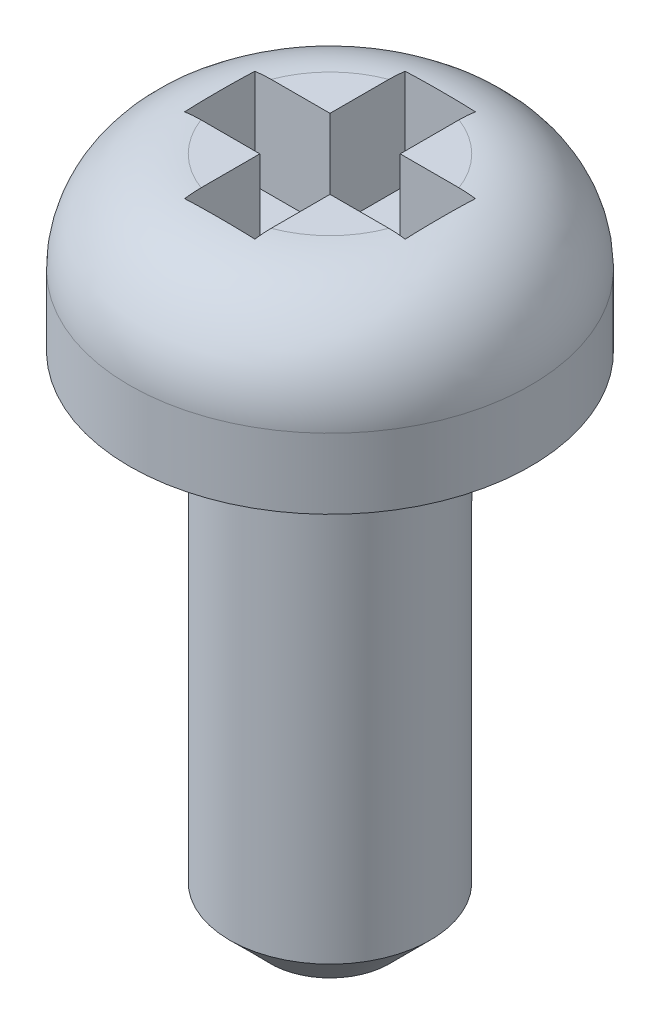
ISO-10303-21;
HEADER;
FILE_DESCRIPTION(('STEP AP214'),'2;1');
FILE_NAME('part.step','',(''),(''),'','','');
FILE_SCHEMA(('AUTOMOTIVE_DESIGN { 1 0 10303 214 1 1 1 1 }'));
ENDSEC;
DATA;
#1=APPLICATION_CONTEXT('core data for automotive mechanical design processes');
#2=APPLICATION_PROTOCOL_DEFINITION('international standard','automotive_design',2000,#1);
#3=PRODUCT_CONTEXT('',#1,'mechanical');
#4=PRODUCT('Part','Part','',(#3));
#5=PRODUCT_RELATED_PRODUCT_CATEGORY('part','',(#4));
#6=PRODUCT_DEFINITION_FORMATION('','',#4);
#7=PRODUCT_DEFINITION_CONTEXT('part definition',#1,'design');
#8=PRODUCT_DEFINITION('design','',#6,#7);
#9=PRODUCT_DEFINITION_SHAPE('','',#8);
#10=(LENGTH_UNIT() NAMED_UNIT(*) SI_UNIT(.MILLI.,.METRE.));
#11=(NAMED_UNIT(*) PLANE_ANGLE_UNIT() SI_UNIT($,.RADIAN.));
#12=(NAMED_UNIT(*) SI_UNIT($,.STERADIAN.) SOLID_ANGLE_UNIT());
#13=UNCERTAINTY_MEASURE_WITH_UNIT(LENGTH_MEASURE(1.E-05),#10,'distance_accuracy_value','');
#14=(GEOMETRIC_REPRESENTATION_CONTEXT(3) GLOBAL_UNCERTAINTY_ASSIGNED_CONTEXT((#13)) GLOBAL_UNIT_ASSIGNED_CONTEXT((#10,
#11,#12)) REPRESENTATION_CONTEXT('',''));
#15=CARTESIAN_POINT('',(0.,0.,0.));
#16=DIRECTION('',(0.,0.,1.));
#17=DIRECTION('',(1.,0.,0.));
#18=AXIS2_PLACEMENT_3D('',#15,#16,#17);
#19=CARTESIAN_POINT('',(2.,0.,0.));
#20=DIRECTION('',(0.,1.,0.));
#21=DIRECTION('',(0.,0.,1.));
#22=AXIS2_PLACEMENT_3D('',#19,#20,#21);
#23=PLANE('',#22);
#24=CARTESIAN_POINT('',(0.,0.,0.));
#25=DIRECTION('',(0.,1.,0.));
#26=DIRECTION('',(0.,0.,1.));
#27=AXIS2_PLACEMENT_3D('',#24,#25,#26);
#28=CIRCLE('',#27,1.4572);
#29=CARTESIAN_POINT('',(0.,0.,1.4572));
#30=VERTEX_POINT('',#29);
#31=EDGE_CURVE('E228',#30,#30,#28,.T.);
#32=ORIENTED_EDGE('',*,*,#31,.T.);
#33=EDGE_LOOP('',(#32));
#34=FACE_BOUND('',#33,.T.);
#35=CARTESIAN_POINT('',(0.,0.,0.));
#36=DIRECTION('',(0.,1.,0.));
#37=DIRECTION('',(0.,0.,1.));
#38=AXIS2_PLACEMENT_3D('',#35,#36,#37);
#39=CIRCLE('',#38,2.);
#40=CARTESIAN_POINT('',(0.,0.,2.));
#41=VERTEX_POINT('',#40);
#42=EDGE_CURVE('E271',#41,#41,#39,.T.);
#43=ORIENTED_EDGE('',*,*,#42,.F.);
#44=EDGE_LOOP('',(#43));
#45=FACE_BOUND('',#44,.T.);
#46=ADVANCED_FACE('F31',(#34,#45),#23,.F.);
#47=CARTESIAN_POINT('',(0.,1.7,0.));
#48=DIRECTION('',(0.,-1.,0.));
#49=DIRECTION('',(0.,0.,-1.));
#50=AXIS2_PLACEMENT_3D('',#47,#48,#49);
#51=PLANE('',#50);
#52=DIRECTION('',(-1.,0.,0.));
#53=VECTOR('',#52,1.);
#54=CARTESIAN_POINT('',(1.1,1.7,0.349999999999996));
#55=LINE('',#54,#53);
#56=CARTESIAN_POINT('',(-0.35,1.7,0.350000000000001));
#57=VERTEX_POINT('',#56);
#58=CARTESIAN_POINT('',(-0.93674969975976,1.7,0.350000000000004));
#59=VERTEX_POINT('',#58);
#60=EDGE_CURVE('E370',#57,#59,#55,.T.);
#61=ORIENTED_EDGE('',*,*,#60,.T.);
#62=CARTESIAN_POINT('',(0.,1.7,0.));
#63=DIRECTION('',(0.,1.,0.));
#64=DIRECTION('',(0.,0.,1.));
#65=AXIS2_PLACEMENT_3D('',#62,#63,#64);
#66=CIRCLE('',#65,1.);
#67=CARTESIAN_POINT('',(-0.35,1.7,0.936749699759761));
#68=VERTEX_POINT('',#67);
#69=EDGE_CURVE('E317',#59,#68,#66,.T.);
#70=ORIENTED_EDGE('',*,*,#69,.T.);
#71=DIRECTION('',(0.,0.,1.));
#72=VECTOR('',#71,1.);
#73=CARTESIAN_POINT('',(-0.35,1.7,0.));
#74=LINE('',#73,#72);
#75=EDGE_CURVE('E272',#57,#68,#74,.T.);
#76=ORIENTED_EDGE('',*,*,#75,.F.);
#77=EDGE_LOOP('',(#61,#70,#76));
#78=FACE_BOUND('',#77,.T.);
#79=ADVANCED_FACE('F244',(#78),#51,.F.);
#80=CARTESIAN_POINT('',(0.936749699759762,1.7,0.349999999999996));
#81=VERTEX_POINT('',#80);
#82=CARTESIAN_POINT('',(0.35,1.7,0.349999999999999));
#83=VERTEX_POINT('',#82);
#84=EDGE_CURVE('E152',#81,#83,#55,.T.);
#85=ORIENTED_EDGE('',*,*,#84,.T.);
#86=DIRECTION('',(0.,0.,1.));
#87=VECTOR('',#86,1.);
#88=CARTESIAN_POINT('',(0.35,1.7,0.));
#89=LINE('',#88,#87);
#90=CARTESIAN_POINT('',(0.35,1.7,0.936749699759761));
#91=VERTEX_POINT('',#90);
#92=EDGE_CURVE('E282',#83,#91,#89,.T.);
#93=ORIENTED_EDGE('',*,*,#92,.T.);
#94=EDGE_CURVE('E277',#91,#81,#66,.T.);
#95=ORIENTED_EDGE('',*,*,#94,.T.);
#96=EDGE_LOOP('',(#85,#93,#95));
#97=FACE_BOUND('',#96,.T.);
#98=ADVANCED_FACE('F250',(#97),#51,.F.);
#99=CARTESIAN_POINT('',(0.35,0.7,1.1));
#100=DIRECTION('',(1.,0.,0.));
#101=DIRECTION('',(0.,0.,-1.));
#102=AXIS2_PLACEMENT_3D('',#99,#100,#101);
#103=PLANE('',#102);
#104=DIRECTION('',(0.,1.,0.));
#105=VECTOR('',#104,1.);
#106=CARTESIAN_POINT('',(0.35,0.7,0.349999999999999));
#107=LINE('',#106,#105);
#108=CARTESIAN_POINT('',(0.35,0.7,0.349999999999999));
#109=VERTEX_POINT('',#108);
#110=EDGE_CURVE('E177',#109,#83,#107,.T.);
#111=ORIENTED_EDGE('',*,*,#110,.F.);
#112=DIRECTION('',(0.,0.,-1.));
#113=VECTOR('',#112,1.);
#114=CARTESIAN_POINT('',(0.35,0.7,1.1));
#115=LINE('',#114,#113);
#116=CARTESIAN_POINT('',(0.35,0.7,1.1));
#117=VERTEX_POINT('',#116);
#118=EDGE_CURVE('E341',#117,#109,#115,.T.);
#119=ORIENTED_EDGE('',*,*,#118,.F.);
#120=DIRECTION('',(0.,1.,0.));
#121=VECTOR('',#120,1.);
#122=CARTESIAN_POINT('',(0.35,0.7,1.1));
#123=LINE('',#122,#121);
#124=CARTESIAN_POINT('',(0.35,1.68801785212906,1.1));
#125=VERTEX_POINT('',#124);
#126=EDGE_CURVE('E353',#117,#125,#123,.T.);
#127=ORIENTED_EDGE('',*,*,#126,.T.);
#128=CARTESIAN_POINT('',(0.35,1.45993420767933,0.));
#129=CARTESIAN_POINT('',(0.35,1.45993385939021,0.0125843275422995));
#130=CARTESIAN_POINT('',(0.35,1.46051958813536,0.0251680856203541));
#131=CARTESIAN_POINT('',(0.35,1.4628038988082,0.0502432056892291));
#132=CARTESIAN_POINT('',(0.35,1.46450352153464,0.0627344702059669));
#133=CARTESIAN_POINT('',(0.35,1.4689023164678,0.0877653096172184));
#134=CARTESIAN_POINT('',(0.35,1.47161880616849,0.100301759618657));
#135=CARTESIAN_POINT('',(0.35,1.47784150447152,0.125168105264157));
#136=CARTESIAN_POINT('',(0.35,1.48134743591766,0.137498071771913));
#137=CARTESIAN_POINT('',(0.35,1.49345616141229,0.176545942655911));
#138=CARTESIAN_POINT('',(0.35,1.50315725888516,0.202914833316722));
#139=CARTESIAN_POINT('',(0.35,1.52364945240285,0.255232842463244));
#140=CARTESIAN_POINT('',(0.35,1.53444204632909,0.281181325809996));
#141=CARTESIAN_POINT('',(0.35,1.55610137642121,0.33312246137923));
#142=CARTESIAN_POINT('',(0.35,1.56696822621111,0.359115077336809));
#143=CARTESIAN_POINT('',(0.35,1.58809596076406,0.411343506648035));
#144=CARTESIAN_POINT('',(0.35,1.59835688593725,0.437579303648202));
#145=CARTESIAN_POINT('',(0.35,1.62729470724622,0.516216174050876));
#146=CARTESIAN_POINT('',(0.35,1.64443411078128,0.569212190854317));
#147=CARTESIAN_POINT('',(0.35,1.67238896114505,0.676850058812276));
#148=CARTESIAN_POINT('',(0.35,1.68321258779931,0.731489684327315));
#149=CARTESIAN_POINT('',(0.35,1.69415650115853,0.816758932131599));
#150=CARTESIAN_POINT('',(0.35,1.69690392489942,0.847063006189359));
#151=CARTESIAN_POINT('',(0.35,1.70003065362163,0.907785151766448));
#152=CARTESIAN_POINT('',(0.35,1.70041041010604,0.938203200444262));
#153=CARTESIAN_POINT('',(0.35,1.69782325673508,1.02992395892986));
#154=CARTESIAN_POINT('',(0.35,1.69105969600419,1.09117295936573));
#155=CARTESIAN_POINT('',(0.35,1.66711982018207,1.21164332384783));
#156=CARTESIAN_POINT('',(0.35,1.64993580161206,1.27086315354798));
#157=CARTESIAN_POINT('',(0.35,1.60544158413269,1.38515118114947));
#158=CARTESIAN_POINT('',(0.35,1.57816788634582,1.44023349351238));
#159=CARTESIAN_POINT('',(0.35,1.51557529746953,1.54232127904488));
#160=CARTESIAN_POINT('',(0.350000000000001,1.4806602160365,1.5895745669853));
#161=CARTESIAN_POINT('',(0.350000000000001,1.4031007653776,1.67733687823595));
#162=CARTESIAN_POINT('',(0.350000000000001,1.36044944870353,1.71783977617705));
#163=CARTESIAN_POINT('',(0.350000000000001,1.27026706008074,1.78948486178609));
#164=CARTESIAN_POINT('',(0.350000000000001,1.22295175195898,1.8208989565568));
#165=CARTESIAN_POINT('',(0.350000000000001,1.12367197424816,1.87518856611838));
#166=CARTESIAN_POINT('',(0.350000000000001,1.07170942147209,1.89806758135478));
#167=CARTESIAN_POINT('',(0.350000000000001,0.965423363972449,1.93432952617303));
#168=CARTESIAN_POINT('',(0.350000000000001,0.911145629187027,1.94784673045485));
#169=CARTESIAN_POINT('',(0.350000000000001,0.801082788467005,1.96551825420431));
#170=CARTESIAN_POINT('',(0.350000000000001,0.745297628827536,1.9696722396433));
#171=CARTESIAN_POINT('',(0.350000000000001,0.63415863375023,1.96849435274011));
#172=CARTESIAN_POINT('',(0.350000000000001,0.578804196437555,1.96321834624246));
#173=CARTESIAN_POINT('',(0.350000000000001,0.469769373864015,1.94344655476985));
#174=CARTESIAN_POINT('',(0.350000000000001,0.416088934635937,1.92895106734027));
#175=CARTESIAN_POINT('',(0.350000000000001,0.311919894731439,1.89117148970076));
#176=CARTESIAN_POINT('',(0.350000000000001,0.261431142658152,1.86788781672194));
#177=CARTESIAN_POINT('',(0.350000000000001,0.165050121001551,1.81321936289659));
#178=CARTESIAN_POINT('',(0.350000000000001,0.119157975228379,1.78183436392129));
#179=CARTESIAN_POINT('',(0.350000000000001,0.0329785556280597,1.71168360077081));
#180=CARTESIAN_POINT('',(0.350000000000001,-0.00727539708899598,1.6728769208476));
#181=CARTESIAN_POINT('',(0.350000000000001,-0.0807970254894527,1.58914006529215));
#182=CARTESIAN_POINT('',(0.35,-0.114064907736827,1.54421007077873));
#183=CARTESIAN_POINT('',(0.35,-0.17320156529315,1.44886402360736));
#184=CARTESIAN_POINT('',(0.35,-0.198962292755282,1.39838102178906));
#185=CARTESIAN_POINT('',(0.35,-0.241911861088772,1.29388724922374));
#186=CARTESIAN_POINT('',(0.35,-0.25909819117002,1.23987545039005));
#187=CARTESIAN_POINT('',(0.35,-0.2850530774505,1.12816850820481));
#188=CARTESIAN_POINT('',(0.35,-0.2935536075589,1.07041147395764));
#189=CARTESIAN_POINT('',(0.35,-0.301374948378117,0.954338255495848));
#190=CARTESIAN_POINT('',(0.35,-0.300702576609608,0.896022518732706));
#191=CARTESIAN_POINT('',(0.35,-0.292402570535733,0.798324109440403));
#192=CARTESIAN_POINT('',(0.35,-0.28701776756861,0.758728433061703));
#193=CARTESIAN_POINT('',(0.35,-0.272607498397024,0.680203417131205));
#194=CARTESIAN_POINT('',(0.35,-0.263581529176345,0.641274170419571));
#195=CARTESIAN_POINT('',(0.35,-0.242382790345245,0.564167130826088));
#196=CARTESIAN_POINT('',(0.35,-0.230200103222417,0.525992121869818));
#197=CARTESIAN_POINT('',(0.35,-0.203471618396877,0.450498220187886));
#198=CARTESIAN_POINT('',(0.35,-0.188925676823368,0.413179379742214));
#199=CARTESIAN_POINT('',(0.35,-0.165273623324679,0.355097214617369));
#200=CARTESIAN_POINT('',(0.35,-0.156544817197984,0.33417444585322));
#201=CARTESIAN_POINT('',(0.35,-0.139086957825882,0.292329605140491));
#202=CARTESIAN_POINT('',(0.35,-0.130357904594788,0.271407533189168));
#203=CARTESIAN_POINT('',(0.35,-0.113422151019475,0.229409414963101));
#204=CARTESIAN_POINT('',(0.35,-0.10521413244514,0.208333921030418));
#205=CARTESIAN_POINT('',(0.35,-0.0900330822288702,0.165754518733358));
#206=CARTESIAN_POINT('',(0.35,-0.0830590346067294,0.144250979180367));
#207=CARTESIAN_POINT('',(0.35,-0.0699829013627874,0.0952200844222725));
#208=CARTESIAN_POINT('',(0.35,-0.0645081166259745,0.0675024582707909));
#209=CARTESIAN_POINT('',(0.35,-0.0605007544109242,0.0256162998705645));
#210=CARTESIAN_POINT('',(0.35,-0.0598609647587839,0.011649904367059));
#211=CARTESIAN_POINT('',(0.35,-0.0600205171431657,-0.0162744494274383));
#212=CARTESIAN_POINT('',(0.35,-0.060819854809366,-0.0302324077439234));
#213=CARTESIAN_POINT('',(0.35,-0.0642391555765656,-0.0624304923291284));
#214=CARTESIAN_POINT('',(0.35,-0.0673584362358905,-0.0806166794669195));
#215=CARTESIAN_POINT('',(0.35,-0.0754011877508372,-0.116595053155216));
#216=CARTESIAN_POINT('',(0.35,-0.0803278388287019,-0.134386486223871));
#217=CARTESIAN_POINT('',(0.35,-0.0914507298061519,-0.169873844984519));
#218=CARTESIAN_POINT('',(0.35,-0.097666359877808,-0.187563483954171));
#219=CARTESIAN_POINT('',(0.35,-0.11078437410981,-0.222668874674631));
#220=CARTESIAN_POINT('',(0.35,-0.11768640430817,-0.240084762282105));
#221=CARTESIAN_POINT('',(0.35,-0.13407008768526,-0.280416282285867));
#222=CARTESIAN_POINT('',(0.35,-0.143663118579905,-0.303285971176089));
#223=CARTESIAN_POINT('',(0.35,-0.162748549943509,-0.349067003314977));
#224=CARTESIAN_POINT('',(0.35,-0.172240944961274,-0.371978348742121));
#225=CARTESIAN_POINT('',(0.35,-0.199914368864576,-0.441030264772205));
#226=CARTESIAN_POINT('',(0.35,-0.217299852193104,-0.487506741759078));
#227=CARTESIAN_POINT('',(0.35,-0.247660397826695,-0.581208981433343));
#228=CARTESIAN_POINT('',(0.35,-0.260693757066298,-0.628415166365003));
#229=CARTESIAN_POINT('',(0.35,-0.281545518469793,-0.72397608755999));
#230=CARTESIAN_POINT('',(0.35,-0.289364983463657,-0.772330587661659));
#231=CARTESIAN_POINT('',(0.35,-0.300230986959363,-0.881614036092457));
#232=CARTESIAN_POINT('',(0.35,-0.301638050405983,-0.94272028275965));
#233=CARTESIAN_POINT('',(0.35,-0.294391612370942,-1.06469160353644));
#234=CARTESIAN_POINT('',(0.35,-0.28568346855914,-1.12555356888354));
#235=CARTESIAN_POINT('',(0.35,-0.257889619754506,-1.24497805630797));
#236=CARTESIAN_POINT('',(0.35,-0.23878866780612,-1.3035370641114));
#237=CARTESIAN_POINT('',(0.35,-0.190541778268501,-1.41625117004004));
#238=CARTESIAN_POINT('',(0.35,-0.161414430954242,-1.47041419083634));
#239=CARTESIAN_POINT('',(0.35,-0.0955163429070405,-1.57013279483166));
#240=CARTESIAN_POINT('',(0.35,-0.0591834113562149,-1.6159779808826));
#241=CARTESIAN_POINT('',(0.35,0.0209046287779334,-1.70068915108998));
#242=CARTESIAN_POINT('',(0.35,0.0646618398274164,-1.73955315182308));
#243=CARTESIAN_POINT('',(0.35,0.156828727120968,-1.80793910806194));
#244=CARTESIAN_POINT('',(0.349999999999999,0.205049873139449,-1.83771543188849));
#245=CARTESIAN_POINT('',(0.349999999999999,0.305853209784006,-1.88861588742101));
#246=CARTESIAN_POINT('',(0.349999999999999,0.358434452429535,-1.90974189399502));
#247=CARTESIAN_POINT('',(0.349999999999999,0.46569621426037,-1.94247514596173));
#248=CARTESIAN_POINT('',(0.349999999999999,0.520338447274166,-1.95420796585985));
#249=CARTESIAN_POINT('',(0.349999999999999,0.630820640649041,-1.968280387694));
#250=CARTESIAN_POINT('',(0.349999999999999,0.686660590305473,-1.97062007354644));
#251=CARTESIAN_POINT('',(0.349999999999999,0.797639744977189,-1.9658483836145));
#252=CARTESIAN_POINT('',(0.349999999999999,0.852781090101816,-1.95878658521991));
#253=CARTESIAN_POINT('',(0.349999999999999,0.961094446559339,-1.93550923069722));
#254=CARTESIAN_POINT('',(0.349999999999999,1.01426651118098,-1.91929392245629));
#255=CARTESIAN_POINT('',(0.349999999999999,1.11716635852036,-1.87818110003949));
#256=CARTESIAN_POINT('',(0.349999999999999,1.16689261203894,-1.8532797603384));
#257=CARTESIAN_POINT('',(0.349999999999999,1.26149527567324,-1.79552961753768));
#258=CARTESIAN_POINT('',(0.35,1.30637129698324,-1.76268017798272));
#259=CARTESIAN_POINT('',(0.35,1.39032055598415,-1.68976209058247));
#260=CARTESIAN_POINT('',(0.35,1.42935474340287,-1.6496485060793));
#261=CARTESIAN_POINT('',(0.35,1.50023517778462,-1.56353444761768));
#262=CARTESIAN_POINT('',(0.35,1.53208348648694,-1.51753566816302));
#263=CARTESIAN_POINT('',(0.35,1.58823942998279,-1.42026376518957));
#264=CARTESIAN_POINT('',(0.35,1.61243200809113,-1.36892429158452));
#265=CARTESIAN_POINT('',(0.35,1.65217330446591,-1.26293430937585));
#266=CARTESIAN_POINT('',(0.35,1.66770992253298,-1.20827928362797));
#267=CARTESIAN_POINT('',(0.35,1.69031319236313,-1.09532736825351));
#268=CARTESIAN_POINT('',(0.35,1.69707460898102,-1.03696983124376));
#269=CARTESIAN_POINT('',(0.35,1.70138004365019,-0.920224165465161));
#270=CARTESIAN_POINT('',(0.35,1.6989691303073,-0.861837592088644));
#271=CARTESIAN_POINT('',(0.35,1.68766563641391,-0.762443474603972));
#272=CARTESIAN_POINT('',(0.35,1.68079659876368,-0.721186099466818));
#273=CARTESIAN_POINT('',(0.35,1.66323633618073,-0.639488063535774));
#274=CARTESIAN_POINT('',(0.35,1.6525439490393,-0.599047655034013));
#275=CARTESIAN_POINT('',(0.35,1.62779463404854,-0.518389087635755));
#276=CARTESIAN_POINT('',(0.35,1.61367745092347,-0.478189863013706));
#277=CARTESIAN_POINT('',(0.35,1.58328779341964,-0.398647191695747));
#278=CARTESIAN_POINT('',(0.35,1.56701542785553,-0.359303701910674));
#279=CARTESIAN_POINT('',(0.35,1.5397174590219,-0.293821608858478));
#280=CARTESIAN_POINT('',(0.35,1.52875225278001,-0.267655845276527));
#281=CARTESIAN_POINT('',(0.35,1.50770720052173,-0.214909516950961));
#282=CARTESIAN_POINT('',(0.35,1.49762884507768,-0.188328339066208));
#283=CARTESIAN_POINT('',(0.35,1.48030411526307,-0.135150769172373));
#284=CARTESIAN_POINT('',(0.35,1.4729746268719,-0.108584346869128));
#285=CARTESIAN_POINT('',(0.35,1.46531382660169,-0.0681398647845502));
#286=CARTESIAN_POINT('',(0.35,1.46331648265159,-0.0545867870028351));
#287=CARTESIAN_POINT('',(0.35,1.46062727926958,-0.0273555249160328));
#288=CARTESIAN_POINT('',(0.35,1.4599345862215,-0.0136774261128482));
#289=CARTESIAN_POINT('',(0.35,1.45993420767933,0.));
#290=B_SPLINE_CURVE_WITH_KNOTS('',3,(#128,#129,#130,#131,#132,#133,#134,#135,#136,#137,#138,
#139,#140,#141,#142,#143,#144,#145,#146,#147,#148,#149,#150,#151,#152,#153,#154,#155,#156,#157,
#158,#159,#160,#161,#162,#163,#164,#165,#166,#167,#168,#169,#170,#171,#172,#173,#174,#175,#176,
#177,#178,#179,#180,#181,#182,#183,#184,#185,#186,#187,#188,#189,#190,#191,#192,#193,#194,#195,
#196,#197,#198,#199,#200,#201,#202,#203,#204,#205,#206,#207,#208,#209,#210,#211,#212,#213,#214,
#215,#216,#217,#218,#219,#220,#221,#222,#223,#224,#225,#226,#227,#228,#229,#230,#231,#232,#233,
#234,#235,#236,#237,#238,#239,#240,#241,#242,#243,#244,#245,#246,#247,#248,#249,#250,#251,#252,
#253,#254,#255,#256,#257,#258,#259,#260,#261,#262,#263,#264,#265,#266,#267,#268,#269,#270,#271,
#272,#273,#274,#275,#276,#277,#278,#279,#280,#281,#282,#283,#284,#285,#286,#287,#288,#289),
.UNSPECIFIED.,.T.,.F.,(4,2,2,2,2,2,2,2,2,2,2,2,2,2,2,2,2,2,2,2,2,2,2,2,2,2,2,2,2,2,2,2,2,2,2,2,
2,2,2,2,2,2,2,2,2,2,2,2,2,2,2,2,2,2,2,2,2,2,2,2,2,2,2,2,2,2,2,2,2,2,2,2,2,2,2,2,2,2,2,2,4),(0.,
0.0377393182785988,0.0755139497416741,0.11396354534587,0.152399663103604,0.236600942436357,
0.320919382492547,0.405432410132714,0.489939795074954,0.656759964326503,0.823363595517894,
0.914564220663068,1.00574745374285,1.18967096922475,1.37373061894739,1.55713081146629,
1.73251377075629,1.90805501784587,2.07761552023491,2.24710640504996,2.41411295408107,
2.58112546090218,2.74715181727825,2.91317281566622,3.07918593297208,3.24520352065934,
3.41216421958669,3.57911998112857,3.74837179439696,3.91767313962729,4.09205397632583,
4.26630521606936,4.38601670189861,4.50574473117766,4.62585357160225,4.74596972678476,
4.81398262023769,4.8819935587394,4.94982494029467,5.017600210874,5.10190210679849,
5.14377357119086,5.18564490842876,5.24086935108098,5.29619143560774,5.35241551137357,
5.40861074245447,5.48300944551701,5.55741215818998,5.70615817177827,5.85282331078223,
5.9994585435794,6.18203209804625,6.36559651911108,6.54943097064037,6.73292638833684,
6.90754700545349,7.08221715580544,7.25141919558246,7.42058454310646,7.58744873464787,
7.75431143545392,7.92029768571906,8.08627944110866,8.25233439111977,8.41840264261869,
8.58553566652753,8.7526206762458,8.9221090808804,9.09183382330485,9.26731666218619,
9.44193837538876,9.56722798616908,9.69255571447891,9.82027267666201,9.94798319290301,
10.0330944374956,10.1183461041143,10.2007594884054,10.2418031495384,10.2828205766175),.UNSPECIFIED.);
#291=EDGE_CURVE('E309',#91,#125,#290,.T.);
#292=ORIENTED_EDGE('',*,*,#291,.F.);
#293=ORIENTED_EDGE('',*,*,#92,.F.);
#294=EDGE_LOOP('',(#111,#119,#127,#292,#293));
#295=FACE_BOUND('',#294,.T.);
#296=ADVANCED_FACE('F302',(#295),#103,.F.);
#297=CARTESIAN_POINT('',(-0.35,0.7,1.1));
#298=DIRECTION('',(1.,0.,0.));
#299=DIRECTION('',(0.,0.,-1.));
#300=AXIS2_PLACEMENT_3D('',#297,#298,#299);
#301=PLANE('',#300);
#302=DIRECTION('',(0.,0.,-1.));
#303=VECTOR('',#302,1.);
#304=CARTESIAN_POINT('',(-0.35,0.7,1.1));
#305=LINE('',#304,#303);
#306=CARTESIAN_POINT('',(-0.35,0.7,1.1));
#307=VERTEX_POINT('',#306);
#308=CARTESIAN_POINT('',(-0.35,0.7,0.35));
#309=VERTEX_POINT('',#308);
#310=EDGE_CURVE('E347',#307,#309,#305,.T.);
#311=ORIENTED_EDGE('',*,*,#310,.T.);
#312=DIRECTION('',(0.,1.,0.));
#313=VECTOR('',#312,1.);
#314=CARTESIAN_POINT('',(-0.35,0.7,0.350000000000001));
#315=LINE('',#314,#313);
#316=EDGE_CURVE('E174',#309,#57,#315,.T.);
#317=ORIENTED_EDGE('',*,*,#316,.T.);
#318=ORIENTED_EDGE('',*,*,#75,.T.);
#319=CARTESIAN_POINT('',(-0.35,1.45993420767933,0.));
#320=CARTESIAN_POINT('',(-0.35,1.45993385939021,0.0125843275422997));
#321=CARTESIAN_POINT('',(-0.35,1.46051958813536,0.0251680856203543));
#322=CARTESIAN_POINT('',(-0.35,1.4628038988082,0.0502432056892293));
#323=CARTESIAN_POINT('',(-0.35,1.46450352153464,0.0627344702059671));
#324=CARTESIAN_POINT('',(-0.35,1.4689023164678,0.0877653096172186));
#325=CARTESIAN_POINT('',(-0.35,1.47161880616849,0.100301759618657));
#326=CARTESIAN_POINT('',(-0.35,1.47784150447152,0.125168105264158));
#327=CARTESIAN_POINT('',(-0.35,1.48134743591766,0.137498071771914));
#328=CARTESIAN_POINT('',(-0.35,1.49345616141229,0.176545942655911));
#329=CARTESIAN_POINT('',(-0.35,1.50315725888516,0.202914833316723));
#330=CARTESIAN_POINT('',(-0.35,1.52364945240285,0.255232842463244));
#331=CARTESIAN_POINT('',(-0.35,1.53444204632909,0.281181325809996));
#332=CARTESIAN_POINT('',(-0.35,1.55610137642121,0.33312246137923));
#333=CARTESIAN_POINT('',(-0.35,1.56696822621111,0.359115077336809));
#334=CARTESIAN_POINT('',(-0.35,1.58809596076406,0.411343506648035));
#335=CARTESIAN_POINT('',(-0.35,1.59835688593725,0.437579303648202));
#336=CARTESIAN_POINT('',(-0.35,1.62729470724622,0.516216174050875));
#337=CARTESIAN_POINT('',(-0.35,1.64443411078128,0.569212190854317));
#338=CARTESIAN_POINT('',(-0.35,1.67238896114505,0.676850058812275));
#339=CARTESIAN_POINT('',(-0.35,1.68321258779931,0.731489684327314));
#340=CARTESIAN_POINT('',(-0.35,1.69415650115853,0.816758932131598));
#341=CARTESIAN_POINT('',(-0.35,1.69690392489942,0.847063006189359));
#342=CARTESIAN_POINT('',(-0.35,1.70003065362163,0.907785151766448));
#343=CARTESIAN_POINT('',(-0.35,1.70041041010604,0.938203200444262));
#344=CARTESIAN_POINT('',(-0.35,1.69782325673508,1.02992395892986));
#345=CARTESIAN_POINT('',(-0.35,1.69105969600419,1.09117295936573));
#346=CARTESIAN_POINT('',(-0.35,1.66711982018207,1.21164332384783));
#347=CARTESIAN_POINT('',(-0.35,1.64993580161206,1.27086315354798));
#348=CARTESIAN_POINT('',(-0.35,1.60544158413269,1.38515118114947));
#349=CARTESIAN_POINT('',(-0.35,1.57816788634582,1.44023349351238));
#350=CARTESIAN_POINT('',(-0.35,1.51557529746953,1.54232127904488));
#351=CARTESIAN_POINT('',(-0.349999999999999,1.4806602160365,1.5895745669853));
#352=CARTESIAN_POINT('',(-0.349999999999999,1.4031007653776,1.67733687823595));
#353=CARTESIAN_POINT('',(-0.349999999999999,1.36044944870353,1.71783977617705));
#354=CARTESIAN_POINT('',(-0.349999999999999,1.27026706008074,1.78948486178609));
#355=CARTESIAN_POINT('',(-0.349999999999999,1.22295175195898,1.8208989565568));
#356=CARTESIAN_POINT('',(-0.349999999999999,1.12367197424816,1.87518856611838));
#357=CARTESIAN_POINT('',(-0.349999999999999,1.07170942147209,1.89806758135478));
#358=CARTESIAN_POINT('',(-0.349999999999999,0.96542336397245,1.93432952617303));
#359=CARTESIAN_POINT('',(-0.349999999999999,0.911145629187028,1.94784673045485));
#360=CARTESIAN_POINT('',(-0.349999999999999,0.801082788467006,1.96551825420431));
#361=CARTESIAN_POINT('',(-0.349999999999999,0.745297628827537,1.9696722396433));
#362=CARTESIAN_POINT('',(-0.349999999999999,0.634158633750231,1.96849435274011));
#363=CARTESIAN_POINT('',(-0.349999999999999,0.578804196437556,1.96321834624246));
#364=CARTESIAN_POINT('',(-0.349999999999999,0.469769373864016,1.94344655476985));
#365=CARTESIAN_POINT('',(-0.349999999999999,0.416088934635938,1.92895106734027));
#366=CARTESIAN_POINT('',(-0.349999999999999,0.31191989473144,1.89117148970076));
#367=CARTESIAN_POINT('',(-0.349999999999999,0.261431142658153,1.86788781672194));
#368=CARTESIAN_POINT('',(-0.349999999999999,0.165050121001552,1.81321936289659));
#369=CARTESIAN_POINT('',(-0.349999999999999,0.11915797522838,1.78183436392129));
#370=CARTESIAN_POINT('',(-0.349999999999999,0.0329785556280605,1.71168360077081));
#371=CARTESIAN_POINT('',(-0.349999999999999,-0.0072753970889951,1.6728769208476));
#372=CARTESIAN_POINT('',(-0.349999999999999,-0.0807970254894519,1.58914006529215));
#373=CARTESIAN_POINT('',(-0.35,-0.114064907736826,1.54421007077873));
#374=CARTESIAN_POINT('',(-0.35,-0.173201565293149,1.44886402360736));
#375=CARTESIAN_POINT('',(-0.35,-0.198962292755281,1.39838102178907));
#376=CARTESIAN_POINT('',(-0.35,-0.241911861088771,1.29388724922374));
#377=CARTESIAN_POINT('',(-0.35,-0.25909819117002,1.23987545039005));
#378=CARTESIAN_POINT('',(-0.35,-0.2850530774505,1.12816850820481));
#379=CARTESIAN_POINT('',(-0.35,-0.2935536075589,1.07041147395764));
#380=CARTESIAN_POINT('',(-0.35,-0.301374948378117,0.95433825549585));
#381=CARTESIAN_POINT('',(-0.35,-0.300702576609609,0.896022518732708));
#382=CARTESIAN_POINT('',(-0.35,-0.292402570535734,0.798324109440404));
#383=CARTESIAN_POINT('',(-0.35,-0.28701776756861,0.758728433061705));
#384=CARTESIAN_POINT('',(-0.35,-0.272607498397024,0.680203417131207));
#385=CARTESIAN_POINT('',(-0.35,-0.263581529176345,0.641274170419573));
#386=CARTESIAN_POINT('',(-0.35,-0.242382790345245,0.56416713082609));
#387=CARTESIAN_POINT('',(-0.35,-0.230200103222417,0.52599212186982));
#388=CARTESIAN_POINT('',(-0.35,-0.203471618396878,0.450498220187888));
#389=CARTESIAN_POINT('',(-0.35,-0.188925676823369,0.413179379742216));
#390=CARTESIAN_POINT('',(-0.35,-0.16527362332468,0.355097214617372));
#391=CARTESIAN_POINT('',(-0.35,-0.156544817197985,0.334174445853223));
#392=CARTESIAN_POINT('',(-0.35,-0.139086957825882,0.292329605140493));
#393=CARTESIAN_POINT('',(-0.35,-0.130357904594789,0.27140753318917));
#394=CARTESIAN_POINT('',(-0.35,-0.113422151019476,0.229409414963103));
#395=CARTESIAN_POINT('',(-0.35,-0.10521413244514,0.20833392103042));
#396=CARTESIAN_POINT('',(-0.35,-0.0900330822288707,0.16575451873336));
#397=CARTESIAN_POINT('',(-0.35,-0.0830590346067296,0.144250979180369));
#398=CARTESIAN_POINT('',(-0.35,-0.0699829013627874,0.0952200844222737));
#399=CARTESIAN_POINT('',(-0.35,-0.0645081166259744,0.067502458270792));
#400=CARTESIAN_POINT('',(-0.35,-0.060500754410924,0.0256162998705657));
#401=CARTESIAN_POINT('',(-0.35,-0.0598609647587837,0.0116499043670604));
#402=CARTESIAN_POINT('',(-0.35,-0.0600205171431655,-0.016274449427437));
#403=CARTESIAN_POINT('',(-0.35,-0.0608198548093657,-0.0302324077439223));
#404=CARTESIAN_POINT('',(-0.35,-0.0642391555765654,-0.0624304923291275));
#405=CARTESIAN_POINT('',(-0.35,-0.0673584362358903,-0.0806166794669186));
#406=CARTESIAN_POINT('',(-0.35,-0.075401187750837,-0.116595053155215));
#407=CARTESIAN_POINT('',(-0.35,-0.0803278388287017,-0.13438648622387));
#408=CARTESIAN_POINT('',(-0.35,-0.0914507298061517,-0.169873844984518));
#409=CARTESIAN_POINT('',(-0.35,-0.0976663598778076,-0.18756348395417));
#410=CARTESIAN_POINT('',(-0.35,-0.11078437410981,-0.22266887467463));
#411=CARTESIAN_POINT('',(-0.35,-0.11768640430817,-0.240084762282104));
#412=CARTESIAN_POINT('',(-0.35,-0.134070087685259,-0.280416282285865));
#413=CARTESIAN_POINT('',(-0.35,-0.143663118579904,-0.303285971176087));
#414=CARTESIAN_POINT('',(-0.35,-0.162748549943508,-0.349067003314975));
#415=CARTESIAN_POINT('',(-0.35,-0.172240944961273,-0.371978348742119));
#416=CARTESIAN_POINT('',(-0.35,-0.199914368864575,-0.441030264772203));
#417=CARTESIAN_POINT('',(-0.35,-0.217299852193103,-0.487506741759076));
#418=CARTESIAN_POINT('',(-0.35,-0.247660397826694,-0.58120898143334));
#419=CARTESIAN_POINT('',(-0.35,-0.260693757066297,-0.628415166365));
#420=CARTESIAN_POINT('',(-0.35,-0.281545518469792,-0.723976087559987));
#421=CARTESIAN_POINT('',(-0.35,-0.289364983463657,-0.772330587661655));
#422=CARTESIAN_POINT('',(-0.35,-0.300230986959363,-0.881614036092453));
#423=CARTESIAN_POINT('',(-0.35,-0.301638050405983,-0.942720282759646));
#424=CARTESIAN_POINT('',(-0.35,-0.294391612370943,-1.06469160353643));
#425=CARTESIAN_POINT('',(-0.35,-0.28568346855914,-1.12555356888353));
#426=CARTESIAN_POINT('',(-0.35,-0.257889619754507,-1.24497805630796));
#427=CARTESIAN_POINT('',(-0.35,-0.238788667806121,-1.3035370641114));
#428=CARTESIAN_POINT('',(-0.35,-0.190541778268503,-1.41625117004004));
#429=CARTESIAN_POINT('',(-0.35,-0.161414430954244,-1.47041419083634));
#430=CARTESIAN_POINT('',(-0.35,-0.0955163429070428,-1.57013279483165));
#431=CARTESIAN_POINT('',(-0.35,-0.0591834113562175,-1.6159779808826));
#432=CARTESIAN_POINT('',(-0.35,0.0209046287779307,-1.70068915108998));
#433=CARTESIAN_POINT('',(-0.35,0.0646618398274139,-1.73955315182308));
#434=CARTESIAN_POINT('',(-0.35,0.156828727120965,-1.80793910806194));
#435=CARTESIAN_POINT('',(-0.350000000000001,0.205049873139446,-1.83771543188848));
#436=CARTESIAN_POINT('',(-0.350000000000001,0.305853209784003,-1.88861588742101));
#437=CARTESIAN_POINT('',(-0.350000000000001,0.358434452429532,-1.90974189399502));
#438=CARTESIAN_POINT('',(-0.350000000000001,0.465696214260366,-1.94247514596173));
#439=CARTESIAN_POINT('',(-0.350000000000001,0.520338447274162,-1.95420796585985));
#440=CARTESIAN_POINT('',(-0.350000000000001,0.630820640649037,-1.968280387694));
#441=CARTESIAN_POINT('',(-0.350000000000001,0.686660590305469,-1.97062007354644));
#442=CARTESIAN_POINT('',(-0.350000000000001,0.797639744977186,-1.9658483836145));
#443=CARTESIAN_POINT('',(-0.350000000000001,0.852781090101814,-1.95878658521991));
#444=CARTESIAN_POINT('',(-0.350000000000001,0.961094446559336,-1.93550923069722));
#445=CARTESIAN_POINT('',(-0.350000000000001,1.01426651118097,-1.91929392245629));
#446=CARTESIAN_POINT('',(-0.350000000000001,1.11716635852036,-1.87818110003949));
#447=CARTESIAN_POINT('',(-0.350000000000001,1.16689261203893,-1.8532797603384));
#448=CARTESIAN_POINT('',(-0.350000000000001,1.26149527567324,-1.79552961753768));
#449=CARTESIAN_POINT('',(-0.35,1.30637129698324,-1.76268017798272));
#450=CARTESIAN_POINT('',(-0.35,1.39032055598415,-1.68976209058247));
#451=CARTESIAN_POINT('',(-0.35,1.42935474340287,-1.6496485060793));
#452=CARTESIAN_POINT('',(-0.35,1.50023517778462,-1.56353444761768));
#453=CARTESIAN_POINT('',(-0.35,1.53208348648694,-1.51753566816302));
#454=CARTESIAN_POINT('',(-0.35,1.58823942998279,-1.42026376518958));
#455=CARTESIAN_POINT('',(-0.35,1.61243200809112,-1.36892429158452));
#456=CARTESIAN_POINT('',(-0.35,1.65217330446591,-1.26293430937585));
#457=CARTESIAN_POINT('',(-0.35,1.66770992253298,-1.20827928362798));
#458=CARTESIAN_POINT('',(-0.35,1.69031319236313,-1.09532736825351));
#459=CARTESIAN_POINT('',(-0.35,1.69707460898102,-1.03696983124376));
#460=CARTESIAN_POINT('',(-0.35,1.70138004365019,-0.920224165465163));
#461=CARTESIAN_POINT('',(-0.35,1.6989691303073,-0.861837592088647));
#462=CARTESIAN_POINT('',(-0.35,1.68766563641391,-0.762443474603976));
#463=CARTESIAN_POINT('',(-0.35,1.68079659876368,-0.721186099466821));
#464=CARTESIAN_POINT('',(-0.35,1.66323633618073,-0.639488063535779));
#465=CARTESIAN_POINT('',(-0.35,1.6525439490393,-0.599047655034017));
#466=CARTESIAN_POINT('',(-0.35,1.62779463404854,-0.518389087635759));
#467=CARTESIAN_POINT('',(-0.35,1.61367745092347,-0.478189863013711));
#468=CARTESIAN_POINT('',(-0.35,1.58328779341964,-0.398647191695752));
#469=CARTESIAN_POINT('',(-0.35,1.56701542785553,-0.35930370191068));
#470=CARTESIAN_POINT('',(-0.35,1.5397174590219,-0.293821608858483));
#471=CARTESIAN_POINT('',(-0.35,1.52875225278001,-0.267655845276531));
#472=CARTESIAN_POINT('',(-0.35,1.50770720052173,-0.214909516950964));
#473=CARTESIAN_POINT('',(-0.35,1.49762884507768,-0.18832833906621));
#474=CARTESIAN_POINT('',(-0.35,1.48030411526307,-0.135150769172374));
#475=CARTESIAN_POINT('',(-0.35,1.4729746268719,-0.108584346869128));
#476=CARTESIAN_POINT('',(-0.35,1.46531382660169,-0.0681398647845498));
#477=CARTESIAN_POINT('',(-0.35,1.46331648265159,-0.0545867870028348));
#478=CARTESIAN_POINT('',(-0.35,1.46062727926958,-0.0273555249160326));
#479=CARTESIAN_POINT('',(-0.35,1.4599345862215,-0.013677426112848));
#480=CARTESIAN_POINT('',(-0.35,1.45993420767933,0.));
#481=B_SPLINE_CURVE_WITH_KNOTS('',3,(#319,#320,#321,#322,#323,#324,#325,#326,#327,#328,#329,
#330,#331,#332,#333,#334,#335,#336,#337,#338,#339,#340,#341,#342,#343,#344,#345,#346,#347,#348,
#349,#350,#351,#352,#353,#354,#355,#356,#357,#358,#359,#360,#361,#362,#363,#364,#365,#366,#367,
#368,#369,#370,#371,#372,#373,#374,#375,#376,#377,#378,#379,#380,#381,#382,#383,#384,#385,#386,
#387,#388,#389,#390,#391,#392,#393,#394,#395,#396,#397,#398,#399,#400,#401,#402,#403,#404,#405,
#406,#407,#408,#409,#410,#411,#412,#413,#414,#415,#416,#417,#418,#419,#420,#421,#422,#423,#424,
#425,#426,#427,#428,#429,#430,#431,#432,#433,#434,#435,#436,#437,#438,#439,#440,#441,#442,#443,
#444,#445,#446,#447,#448,#449,#450,#451,#452,#453,#454,#455,#456,#457,#458,#459,#460,#461,#462,
#463,#464,#465,#466,#467,#468,#469,#470,#471,#472,#473,#474,#475,#476,#477,#478,#479,#480),
.UNSPECIFIED.,.T.,.F.,(4,2,2,2,2,2,2,2,2,2,2,2,2,2,2,2,2,2,2,2,2,2,2,2,2,2,2,2,2,2,2,2,2,2,2,2,
2,2,2,2,2,2,2,2,2,2,2,2,2,2,2,2,2,2,2,2,2,2,2,2,2,2,2,2,2,2,2,2,2,2,2,2,2,2,2,2,2,2,2,2,4),(0.,
0.0377393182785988,0.0755139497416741,0.11396354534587,0.152399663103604,0.236600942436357,
0.320919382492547,0.405432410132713,0.489939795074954,0.656759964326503,0.823363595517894,
0.914564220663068,1.00574745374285,1.18967096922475,1.37373061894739,1.55713081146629,
1.73251377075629,1.90805501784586,2.07761552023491,2.24710640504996,2.41411295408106,
2.58112546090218,2.74715181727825,2.91317281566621,3.07918593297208,3.24520352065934,
3.41216421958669,3.57911998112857,3.74837179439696,3.91767313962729,4.09205397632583,
4.26630521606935,4.38601670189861,4.50574473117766,4.62585357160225,4.74596972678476,
4.81398262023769,4.8819935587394,4.94982494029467,5.017600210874,5.10190210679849,
5.14377357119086,5.18564490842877,5.24086935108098,5.29619143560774,5.35241551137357,
5.40861074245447,5.48300944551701,5.55741215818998,5.70615817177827,5.85282331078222,
5.9994585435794,6.18203209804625,6.36559651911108,6.54943097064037,6.73292638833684,
6.90754700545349,7.08221715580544,7.25141919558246,7.42058454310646,7.58744873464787,
7.75431143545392,7.92029768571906,8.08627944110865,8.25233439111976,8.41840264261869,
8.58553566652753,8.7526206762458,8.9221090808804,9.09183382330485,9.26731666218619,
9.44193837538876,9.56722798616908,9.6925557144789,9.82027267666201,9.94798319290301,
10.0330944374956,10.1183461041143,10.2007594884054,10.2418031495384,10.2828205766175),.UNSPECIFIED.);
#482=CARTESIAN_POINT('',(-0.35,1.6880178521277,1.1));
#483=VERTEX_POINT('',#482);
#484=EDGE_CURVE('E310',#68,#483,#481,.T.);
#485=ORIENTED_EDGE('',*,*,#484,.T.);
#486=DIRECTION('',(0.,1.,0.));
#487=VECTOR('',#486,1.);
#488=CARTESIAN_POINT('',(-0.35,0.7,1.1));
#489=LINE('',#488,#487);
#490=EDGE_CURVE('E356',#307,#483,#489,.T.);
#491=ORIENTED_EDGE('',*,*,#490,.F.);
#492=EDGE_LOOP('',(#311,#317,#318,#485,#491));
#493=FACE_BOUND('',#492,.T.);
#494=ADVANCED_FACE('F263',(#493),#301,.T.);
#495=CARTESIAN_POINT('',(-0.35,1.7,-0.936749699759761));
#496=VERTEX_POINT('',#495);
#497=CARTESIAN_POINT('',(-0.936749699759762,1.7,-0.349999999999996));
#498=VERTEX_POINT('',#497);
#499=EDGE_CURVE('E318',#496,#498,#66,.T.);
#500=ORIENTED_EDGE('',*,*,#499,.T.);
#501=DIRECTION('',(-1.,0.,0.));
#502=VECTOR('',#501,1.);
#503=CARTESIAN_POINT('',(1.1,1.7,-0.350000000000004));
#504=LINE('',#503,#502);
#505=CARTESIAN_POINT('',(-0.35,1.7,-0.349999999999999));
#506=VERTEX_POINT('',#505);
#507=EDGE_CURVE('E326',#506,#498,#504,.T.);
#508=ORIENTED_EDGE('',*,*,#507,.F.);
#509=EDGE_CURVE('E275',#496,#506,#74,.T.);
#510=ORIENTED_EDGE('',*,*,#509,.F.);
#511=EDGE_LOOP('',(#500,#508,#510));
#512=FACE_BOUND('',#511,.T.);
#513=ADVANCED_FACE('F256',(#512),#51,.F.);
#514=CARTESIAN_POINT('',(0.,11.592517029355,0.));
#515=DIRECTION('',(0.,1.,0.));
#516=DIRECTION('',(0.,0.,1.));
#517=AXIS2_PLACEMENT_3D('',#514,#515,#516);
#518=CYLINDRICAL_SURFACE('',#517,2.);
#519=CARTESIAN_POINT('',(0.,0.699999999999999,0.));
#520=DIRECTION('',(0.,1.,0.));
#521=DIRECTION('',(0.,0.,1.));
#522=AXIS2_PLACEMENT_3D('',#519,#520,#521);
#523=CIRCLE('',#522,2.);
#524=CARTESIAN_POINT('',(0.,0.699999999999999,2.));
#525=VERTEX_POINT('',#524);
#526=EDGE_CURVE('E268',#525,#525,#523,.T.);
#527=ORIENTED_EDGE('',*,*,#526,.F.);
#528=EDGE_LOOP('',(#527));
#529=FACE_BOUND('',#528,.T.);
#530=ORIENTED_EDGE('',*,*,#42,.T.);
#531=EDGE_LOOP('',(#530));
#532=FACE_BOUND('',#531,.T.);
#533=ADVANCED_FACE('F254',(#529,#532),#518,.T.);
#534=CARTESIAN_POINT('',(0.,0.7,0.));
#535=DIRECTION('',(0.,1.,0.));
#536=DIRECTION('',(0.,0.,1.));
#537=AXIS2_PLACEMENT_3D('',#534,#535,#536);
#538=TOROIDAL_SURFACE('',#537,1.,1.);
#539=CARTESIAN_POINT('',(0.93674969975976,1.7,-0.350000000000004));
#540=VERTEX_POINT('',#539);
#541=CARTESIAN_POINT('',(0.35,1.7,-0.936749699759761));
#542=VERTEX_POINT('',#541);
#543=EDGE_CURVE('E316',#540,#542,#66,.T.);
#544=ORIENTED_EDGE('',*,*,#543,.F.);
#545=CARTESIAN_POINT('',(0.,1.45993420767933,-0.35));
#546=CARTESIAN_POINT('',(0.0125843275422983,1.45993385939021,-0.35));
#547=CARTESIAN_POINT('',(0.0251680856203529,1.46051958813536,-0.35));
#548=CARTESIAN_POINT('',(0.0502432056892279,1.4628038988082,-0.35));
#549=CARTESIAN_POINT('',(0.0627344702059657,1.46450352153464,-0.35));
#550=CARTESIAN_POINT('',(0.0877653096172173,1.4689023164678,-0.35));
#551=CARTESIAN_POINT('',(0.100301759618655,1.47161880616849,-0.35));
#552=CARTESIAN_POINT('',(0.125168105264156,1.47784150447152,-0.350000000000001));
#553=CARTESIAN_POINT('',(0.137498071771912,1.48134743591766,-0.350000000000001));
#554=CARTESIAN_POINT('',(0.17654594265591,1.49345616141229,-0.350000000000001));
#555=CARTESIAN_POINT('',(0.202914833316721,1.50315725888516,-0.350000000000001));
#556=CARTESIAN_POINT('',(0.255232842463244,1.52364945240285,-0.350000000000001));
#557=CARTESIAN_POINT('',(0.281181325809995,1.53444204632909,-0.350000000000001));
#558=CARTESIAN_POINT('',(0.333122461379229,1.55610137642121,-0.350000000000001));
#559=CARTESIAN_POINT('',(0.359115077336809,1.56696822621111,-0.350000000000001));
#560=CARTESIAN_POINT('',(0.411343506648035,1.58809596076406,-0.350000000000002));
#561=CARTESIAN_POINT('',(0.437579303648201,1.59835688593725,-0.350000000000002));
#562=CARTESIAN_POINT('',(0.516216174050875,1.62729470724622,-0.350000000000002));
#563=CARTESIAN_POINT('',(0.569212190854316,1.64443411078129,-0.350000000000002));
#564=CARTESIAN_POINT('',(0.676850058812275,1.67238896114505,-0.350000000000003));
#565=CARTESIAN_POINT('',(0.731489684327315,1.68321258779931,-0.350000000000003));
#566=CARTESIAN_POINT('',(0.816758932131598,1.69415650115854,-0.350000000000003));
#567=CARTESIAN_POINT('',(0.847063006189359,1.69690392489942,-0.350000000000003));
#568=CARTESIAN_POINT('',(0.907785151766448,1.70003065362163,-0.350000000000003));
#569=CARTESIAN_POINT('',(0.938203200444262,1.70041041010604,-0.350000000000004));
#570=CARTESIAN_POINT('',(1.02992395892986,1.69782325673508,-0.350000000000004));
#571=CARTESIAN_POINT('',(1.09117295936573,1.69105969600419,-0.350000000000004));
#572=CARTESIAN_POINT('',(1.21164332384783,1.66711982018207,-0.350000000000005));
#573=CARTESIAN_POINT('',(1.27086315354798,1.64993580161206,-0.350000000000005));
#574=CARTESIAN_POINT('',(1.38515118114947,1.60544158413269,-0.350000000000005));
#575=CARTESIAN_POINT('',(1.44023349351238,1.57816788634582,-0.350000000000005));
#576=CARTESIAN_POINT('',(1.54232127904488,1.51557529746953,-0.350000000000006));
#577=CARTESIAN_POINT('',(1.5895745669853,1.4806602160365,-0.350000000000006));
#578=CARTESIAN_POINT('',(1.67733687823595,1.4031007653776,-0.350000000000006));
#579=CARTESIAN_POINT('',(1.71783977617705,1.36044944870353,-0.350000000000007));
#580=CARTESIAN_POINT('',(1.78948486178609,1.27026706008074,-0.350000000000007));
#581=CARTESIAN_POINT('',(1.8208989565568,1.22295175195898,-0.350000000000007));
#582=CARTESIAN_POINT('',(1.87518856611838,1.12367197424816,-0.350000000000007));
#583=CARTESIAN_POINT('',(1.89806758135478,1.07170942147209,-0.350000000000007));
#584=CARTESIAN_POINT('',(1.93432952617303,0.965423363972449,-0.350000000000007));
#585=CARTESIAN_POINT('',(1.94784673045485,0.911145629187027,-0.350000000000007));
#586=CARTESIAN_POINT('',(1.96551825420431,0.801082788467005,-0.350000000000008));
#587=CARTESIAN_POINT('',(1.9696722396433,0.745297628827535,-0.350000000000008));
#588=CARTESIAN_POINT('',(1.96849435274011,0.63415863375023,-0.350000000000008));
#589=CARTESIAN_POINT('',(1.96321834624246,0.578804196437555,-0.350000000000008));
#590=CARTESIAN_POINT('',(1.94344655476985,0.469769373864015,-0.350000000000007));
#591=CARTESIAN_POINT('',(1.92895106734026,0.416088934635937,-0.350000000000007));
#592=CARTESIAN_POINT('',(1.89117148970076,0.311919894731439,-0.350000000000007));
#593=CARTESIAN_POINT('',(1.86788781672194,0.261431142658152,-0.350000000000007));
#594=CARTESIAN_POINT('',(1.81321936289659,0.165050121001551,-0.350000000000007));
#595=CARTESIAN_POINT('',(1.78183436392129,0.119157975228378,-0.350000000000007));
#596=CARTESIAN_POINT('',(1.71168360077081,0.0329785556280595,-0.350000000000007));
#597=CARTESIAN_POINT('',(1.6728769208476,-0.00727539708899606,-0.350000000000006));
#598=CARTESIAN_POINT('',(1.58914006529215,-0.0807970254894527,-0.350000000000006));
#599=CARTESIAN_POINT('',(1.54421007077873,-0.114064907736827,-0.350000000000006));
#600=CARTESIAN_POINT('',(1.44886402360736,-0.17320156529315,-0.350000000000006));
#601=CARTESIAN_POINT('',(1.39838102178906,-0.198962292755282,-0.350000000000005));
#602=CARTESIAN_POINT('',(1.29388724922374,-0.241911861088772,-0.350000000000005));
#603=CARTESIAN_POINT('',(1.23987545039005,-0.25909819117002,-0.350000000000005));
#604=CARTESIAN_POINT('',(1.12816850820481,-0.2850530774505,-0.350000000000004));
#605=CARTESIAN_POINT('',(1.07041147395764,-0.2935536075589,-0.350000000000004));
#606=CARTESIAN_POINT('',(0.954338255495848,-0.301374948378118,-0.350000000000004));
#607=CARTESIAN_POINT('',(0.896022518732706,-0.300702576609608,-0.350000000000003));
#608=CARTESIAN_POINT('',(0.798324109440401,-0.292402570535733,-0.350000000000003));
#609=CARTESIAN_POINT('',(0.758728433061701,-0.287017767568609,-0.350000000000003));
#610=CARTESIAN_POINT('',(0.680203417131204,-0.272607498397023,-0.350000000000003));
#611=CARTESIAN_POINT('',(0.641274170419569,-0.263581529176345,-0.350000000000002));
#612=CARTESIAN_POINT('',(0.564167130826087,-0.242382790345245,-0.350000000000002));
#613=CARTESIAN_POINT('',(0.525992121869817,-0.230200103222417,-0.350000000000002));
#614=CARTESIAN_POINT('',(0.450498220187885,-0.203471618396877,-0.350000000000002));
#615=CARTESIAN_POINT('',(0.413179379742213,-0.188925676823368,-0.350000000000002));
#616=CARTESIAN_POINT('',(0.355097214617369,-0.165273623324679,-0.350000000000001));
#617=CARTESIAN_POINT('',(0.33417444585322,-0.156544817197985,-0.350000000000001));
#618=CARTESIAN_POINT('',(0.29232960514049,-0.139086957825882,-0.350000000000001));
#619=CARTESIAN_POINT('',(0.271407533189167,-0.130357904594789,-0.350000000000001));
#620=CARTESIAN_POINT('',(0.229409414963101,-0.113422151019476,-0.350000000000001));
#621=CARTESIAN_POINT('',(0.208333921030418,-0.10521413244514,-0.350000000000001));
#622=CARTESIAN_POINT('',(0.165754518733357,-0.0900330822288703,-0.350000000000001));
#623=CARTESIAN_POINT('',(0.144250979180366,-0.0830590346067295,-0.350000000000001));
#624=CARTESIAN_POINT('',(0.0952200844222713,-0.0699829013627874,-0.35));
#625=CARTESIAN_POINT('',(0.0675024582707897,-0.0645081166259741,-0.35));
#626=CARTESIAN_POINT('',(0.0256162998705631,-0.060500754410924,-0.35));
#627=CARTESIAN_POINT('',(0.0116499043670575,-0.0598609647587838,-0.35));
#628=CARTESIAN_POINT('',(-0.0162744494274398,-0.0600205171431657,-0.35));
#629=CARTESIAN_POINT('',(-0.0302324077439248,-0.0608198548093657,-0.35));
#630=CARTESIAN_POINT('',(-0.0624304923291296,-0.0642391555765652,-0.35));
#631=CARTESIAN_POINT('',(-0.0806166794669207,-0.0673584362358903,-0.35));
#632=CARTESIAN_POINT('',(-0.116595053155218,-0.0754011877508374,-0.35));
#633=CARTESIAN_POINT('',(-0.134386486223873,-0.0803278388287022,-0.35));
#634=CARTESIAN_POINT('',(-0.169873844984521,-0.0914507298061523,-0.349999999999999));
#635=CARTESIAN_POINT('',(-0.187563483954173,-0.0976663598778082,-0.349999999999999));
#636=CARTESIAN_POINT('',(-0.222668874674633,-0.11078437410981,-0.349999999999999));
#637=CARTESIAN_POINT('',(-0.240084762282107,-0.11768640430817,-0.349999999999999));
#638=CARTESIAN_POINT('',(-0.280416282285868,-0.13407008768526,-0.349999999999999));
#639=CARTESIAN_POINT('',(-0.30328597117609,-0.143663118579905,-0.349999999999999));
#640=CARTESIAN_POINT('',(-0.349067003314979,-0.162748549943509,-0.349999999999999));
#641=CARTESIAN_POINT('',(-0.371978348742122,-0.172240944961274,-0.349999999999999));
#642=CARTESIAN_POINT('',(-0.441030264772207,-0.199914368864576,-0.349999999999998));
#643=CARTESIAN_POINT('',(-0.48750674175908,-0.217299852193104,-0.349999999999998));
#644=CARTESIAN_POINT('',(-0.581208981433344,-0.247660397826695,-0.349999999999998));
#645=CARTESIAN_POINT('',(-0.628415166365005,-0.260693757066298,-0.349999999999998));
#646=CARTESIAN_POINT('',(-0.723976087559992,-0.281545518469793,-0.349999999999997));
#647=CARTESIAN_POINT('',(-0.77233058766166,-0.289364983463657,-0.349999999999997));
#648=CARTESIAN_POINT('',(-0.881614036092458,-0.300230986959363,-0.349999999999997));
#649=CARTESIAN_POINT('',(-0.942720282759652,-0.301638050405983,-0.349999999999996));
#650=CARTESIAN_POINT('',(-1.06469160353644,-0.294391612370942,-0.349999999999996));
#651=CARTESIAN_POINT('',(-1.12555356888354,-0.285683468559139,-0.349999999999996));
#652=CARTESIAN_POINT('',(-1.24497805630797,-0.257889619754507,-0.349999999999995));
#653=CARTESIAN_POINT('',(-1.3035370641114,-0.23878866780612,-0.349999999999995));
#654=CARTESIAN_POINT('',(-1.41625117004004,-0.190541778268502,-0.349999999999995));
#655=CARTESIAN_POINT('',(-1.47041419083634,-0.161414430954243,-0.349999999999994));
#656=CARTESIAN_POINT('',(-1.57013279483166,-0.0955163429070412,-0.349999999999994));
#657=CARTESIAN_POINT('',(-1.6159779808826,-0.0591834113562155,-0.349999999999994));
#658=CARTESIAN_POINT('',(-1.70068915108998,0.0209046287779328,-0.349999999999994));
#659=CARTESIAN_POINT('',(-1.73955315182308,0.0646618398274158,-0.349999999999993));
#660=CARTESIAN_POINT('',(-1.80793910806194,0.156828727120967,-0.349999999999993));
#661=CARTESIAN_POINT('',(-1.83771543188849,0.205049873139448,-0.349999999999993));
#662=CARTESIAN_POINT('',(-1.88861588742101,0.305853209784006,-0.349999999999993));
#663=CARTESIAN_POINT('',(-1.90974189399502,0.358434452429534,-0.349999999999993));
#664=CARTESIAN_POINT('',(-1.94247514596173,0.465696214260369,-0.349999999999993));
#665=CARTESIAN_POINT('',(-1.95420796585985,0.520338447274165,-0.349999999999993));
#666=CARTESIAN_POINT('',(-1.968280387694,0.63082064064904,-0.349999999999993));
#667=CARTESIAN_POINT('',(-1.97062007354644,0.686660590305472,-0.349999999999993));
#668=CARTESIAN_POINT('',(-1.96584838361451,0.797639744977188,-0.349999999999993));
#669=CARTESIAN_POINT('',(-1.95878658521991,0.852781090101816,-0.349999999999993));
#670=CARTESIAN_POINT('',(-1.93550923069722,0.961094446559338,-0.349999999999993));
#671=CARTESIAN_POINT('',(-1.91929392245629,1.01426651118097,-0.349999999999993));
#672=CARTESIAN_POINT('',(-1.87818110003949,1.11716635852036,-0.349999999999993));
#673=CARTESIAN_POINT('',(-1.8532797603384,1.16689261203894,-0.349999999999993));
#674=CARTESIAN_POINT('',(-1.79552961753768,1.26149527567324,-0.349999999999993));
#675=CARTESIAN_POINT('',(-1.76268017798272,1.30637129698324,-0.349999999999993));
#676=CARTESIAN_POINT('',(-1.68976209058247,1.39032055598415,-0.349999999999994));
#677=CARTESIAN_POINT('',(-1.6496485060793,1.42935474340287,-0.349999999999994));
#678=CARTESIAN_POINT('',(-1.56353444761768,1.50023517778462,-0.349999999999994));
#679=CARTESIAN_POINT('',(-1.51753566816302,1.53208348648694,-0.349999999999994));
#680=CARTESIAN_POINT('',(-1.42026376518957,1.58823942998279,-0.349999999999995));
#681=CARTESIAN_POINT('',(-1.36892429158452,1.61243200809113,-0.349999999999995));
#682=CARTESIAN_POINT('',(-1.26293430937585,1.65217330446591,-0.349999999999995));
#683=CARTESIAN_POINT('',(-1.20827928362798,1.66770992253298,-0.349999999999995));
#684=CARTESIAN_POINT('',(-1.09532736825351,1.69031319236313,-0.349999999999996));
#685=CARTESIAN_POINT('',(-1.03696983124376,1.69707460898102,-0.349999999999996));
#686=CARTESIAN_POINT('',(-0.920224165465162,1.70138004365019,-0.349999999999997));
#687=CARTESIAN_POINT('',(-0.861837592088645,1.6989691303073,-0.349999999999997));
#688=CARTESIAN_POINT('',(-0.762443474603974,1.68766563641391,-0.349999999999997));
#689=CARTESIAN_POINT('',(-0.72118609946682,1.68079659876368,-0.349999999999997));
#690=CARTESIAN_POINT('',(-0.639488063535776,1.66323633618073,-0.349999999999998));
#691=CARTESIAN_POINT('',(-0.599047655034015,1.6525439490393,-0.349999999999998));
#692=CARTESIAN_POINT('',(-0.518389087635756,1.62779463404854,-0.349999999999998));
#693=CARTESIAN_POINT('',(-0.478189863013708,1.61367745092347,-0.349999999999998));
#694=CARTESIAN_POINT('',(-0.398647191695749,1.58328779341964,-0.349999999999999));
#695=CARTESIAN_POINT('',(-0.359303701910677,1.56701542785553,-0.349999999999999));
#696=CARTESIAN_POINT('',(-0.29382160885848,1.5397174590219,-0.349999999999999));
#697=CARTESIAN_POINT('',(-0.267655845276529,1.52875225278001,-0.349999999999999));
#698=CARTESIAN_POINT('',(-0.214909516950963,1.50770720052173,-0.349999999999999));
#699=CARTESIAN_POINT('',(-0.188328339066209,1.49762884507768,-0.349999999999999));
#700=CARTESIAN_POINT('',(-0.135150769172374,1.48030411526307,-0.35));
#701=CARTESIAN_POINT('',(-0.108584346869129,1.4729746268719,-0.35));
#702=CARTESIAN_POINT('',(-0.0681398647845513,1.46531382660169,-0.35));
#703=CARTESIAN_POINT('',(-0.0545867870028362,1.46331648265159,-0.35));
#704=CARTESIAN_POINT('',(-0.027355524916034,1.46062727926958,-0.35));
#705=CARTESIAN_POINT('',(-0.0136774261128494,1.4599345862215,-0.35));
#706=CARTESIAN_POINT('',(0.,1.45993420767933,-0.35));
#707=B_SPLINE_CURVE_WITH_KNOTS('',3,(#545,#546,#547,#548,#549,#550,#551,#552,#553,#554,#555,
#556,#557,#558,#559,#560,#561,#562,#563,#564,#565,#566,#567,#568,#569,#570,#571,#572,#573,#574,
#575,#576,#577,#578,#579,#580,#581,#582,#583,#584,#585,#586,#587,#588,#589,#590,#591,#592,#593,
#594,#595,#596,#597,#598,#599,#600,#601,#602,#603,#604,#605,#606,#607,#608,#609,#610,#611,#612,
#613,#614,#615,#616,#617,#618,#619,#620,#621,#622,#623,#624,#625,#626,#627,#628,#629,#630,#631,
#632,#633,#634,#635,#636,#637,#638,#639,#640,#641,#642,#643,#644,#645,#646,#647,#648,#649,#650,
#651,#652,#653,#654,#655,#656,#657,#658,#659,#660,#661,#662,#663,#664,#665,#666,#667,#668,#669,
#670,#671,#672,#673,#674,#675,#676,#677,#678,#679,#680,#681,#682,#683,#684,#685,#686,#687,#688,
#689,#690,#691,#692,#693,#694,#695,#696,#697,#698,#699,#700,#701,#702,#703,#704,#705,#706),
.UNSPECIFIED.,.T.,.F.,(4,2,2,2,2,2,2,2,2,2,2,2,2,2,2,2,2,2,2,2,2,2,2,2,2,2,2,2,2,2,2,2,2,2,2,2,
2,2,2,2,2,2,2,2,2,2,2,2,2,2,2,2,2,2,2,2,2,2,2,2,2,2,2,2,2,2,2,2,2,2,2,2,2,2,2,2,2,2,2,2,4),(0.,
0.0377393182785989,0.0755139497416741,0.11396354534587,0.152399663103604,0.236600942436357,
0.320919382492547,0.405432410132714,0.489939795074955,0.656759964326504,0.823363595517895,
0.914564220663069,1.00574745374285,1.18967096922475,1.37373061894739,1.55713081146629,
1.73251377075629,1.90805501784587,2.07761552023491,2.24710640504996,2.41411295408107,
2.58112546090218,2.74715181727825,2.91317281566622,3.07918593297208,3.24520352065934,
3.41216421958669,3.57911998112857,3.74837179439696,3.91767313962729,4.09205397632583,
4.26630521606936,4.38601670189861,4.50574473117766,4.62585357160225,4.74596972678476,
4.81398262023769,4.8819935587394,4.94982494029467,5.01760021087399,5.10190210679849,
5.14377357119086,5.18564490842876,5.24086935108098,5.29619143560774,5.35241551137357,
5.40861074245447,5.48300944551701,5.55741215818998,5.70615817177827,5.85282331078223,
5.9994585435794,6.18203209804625,6.36559651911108,6.54943097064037,6.73292638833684,
6.90754700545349,7.08221715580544,7.25141919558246,7.42058454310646,7.58744873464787,
7.75431143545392,7.92029768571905,8.08627944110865,8.25233439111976,8.41840264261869,
8.58553566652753,8.7526206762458,8.9221090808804,9.09183382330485,9.26731666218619,
9.44193837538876,9.56722798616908,9.6925557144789,9.82027267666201,9.94798319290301,
10.0330944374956,10.1183461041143,10.2007594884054,10.2418031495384,10.2828205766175),.UNSPECIFIED.);
#708=CARTESIAN_POINT('',(1.1,1.68801785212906,-0.350000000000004));
#709=VERTEX_POINT('',#708);
#710=EDGE_CURVE('E332',#540,#709,#707,.T.);
#711=ORIENTED_EDGE('',*,*,#710,.T.);
#712=CARTESIAN_POINT('',(1.1,1.69498743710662,0.));
#713=CARTESIAN_POINT('',(1.1,1.69499697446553,-0.071452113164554));
#714=CARTESIAN_POINT('',(1.1,1.69435828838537,-0.142904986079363));
#715=CARTESIAN_POINT('',(1.1,1.69102149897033,-0.285825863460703));
#716=CARTESIAN_POINT('',(1.1,1.68832199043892,-0.357293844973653));
#717=CARTESIAN_POINT('',(1.1,1.6788277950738,-0.499634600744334));
#718=CARTESIAN_POINT('',(1.1,1.67205408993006,-0.57050855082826));
#719=CARTESIAN_POINT('',(1.1,1.65192687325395,-0.711271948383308));
#720=CARTESIAN_POINT('',(1.1,1.63858578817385,-0.781162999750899));
#721=CARTESIAN_POINT('',(1.1,1.60517101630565,-0.910155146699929));
#722=CARTESIAN_POINT('',(1.1,1.58614061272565,-0.969517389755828));
#723=CARTESIAN_POINT('',(1.1,1.5399628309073,-1.08510942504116));
#724=CARTESIAN_POINT('',(1.1,1.51281174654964,-1.14133777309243));
#725=CARTESIAN_POINT('',(1.1,1.44940277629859,-1.24919800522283));
#726=CARTESIAN_POINT('',(1.1,1.41306278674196,-1.30078243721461));
#727=CARTESIAN_POINT('',(1.09999999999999,1.33145455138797,-1.39640199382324));
#728=CARTESIAN_POINT('',(1.09999999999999,1.28619048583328,-1.44044063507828));
#729=CARTESIAN_POINT('',(1.09999999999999,1.19156063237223,-1.51549970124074));
#730=CARTESIAN_POINT('',(1.09999999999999,1.14279056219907,-1.54726783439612));
#731=CARTESIAN_POINT('',(1.09999999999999,1.03995999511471,-1.60061254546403));
#732=CARTESIAN_POINT('',(1.09999999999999,0.985904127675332,-1.62219794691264));
#733=CARTESIAN_POINT('',(1.09999999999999,0.882260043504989,-1.65174188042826));
#734=CARTESIAN_POINT('',(1.09999999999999,0.833087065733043,-1.66117155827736));
#735=CARTESIAN_POINT('',(1.09999999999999,0.733851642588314,-1.67112708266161));
#736=CARTESIAN_POINT('',(1.09999999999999,0.683789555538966,-1.67165643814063));
#737=CARTESIAN_POINT('',(1.09999999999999,0.587052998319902,-1.66400437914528));
#738=CARTESIAN_POINT('',(1.09999999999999,0.540340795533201,-1.65628841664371));
#739=CARTESIAN_POINT('',(1.09999999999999,0.448869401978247,-1.63319257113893));
#740=CARTESIAN_POINT('',(1.09999999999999,0.404109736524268,-1.61781456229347));
#741=CARTESIAN_POINT('',(1.09999999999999,0.317284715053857,-1.57982717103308));
#742=CARTESIAN_POINT('',(1.09999999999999,0.275248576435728,-1.55715129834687));
#743=CARTESIAN_POINT('',(1.09999999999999,0.195258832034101,-1.50546109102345));
#744=CARTESIAN_POINT('',(1.09999999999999,0.157308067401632,-1.47644238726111));
#745=CARTESIAN_POINT('',(1.09999999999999,0.0838370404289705,-1.41098993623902));
#746=CARTESIAN_POINT('',(1.09999999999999,0.0486402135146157,-1.37419431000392));
#747=CARTESIAN_POINT('',(1.1,-0.0158870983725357,-1.2958834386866));
#748=CARTESIAN_POINT('',(1.1,-0.0452225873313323,-1.25437226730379));
#749=CARTESIAN_POINT('',(1.1,-0.109680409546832,-1.14871602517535));
#750=CARTESIAN_POINT('',(1.1,-0.141663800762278,-1.08265262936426));
#751=CARTESIAN_POINT('',(1.1,-0.194603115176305,-0.946146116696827));
#752=CARTESIAN_POINT('',(1.1,-0.215517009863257,-0.87568742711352));
#753=CARTESIAN_POINT('',(1.1,-0.25506958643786,-0.703482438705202));
#754=CARTESIAN_POINT('',(1.1,-0.269252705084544,-0.600762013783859));
#755=CARTESIAN_POINT('',(1.1,-0.28278305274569,-0.446047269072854));
#756=CARTESIAN_POINT('',(1.1,-0.286000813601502,-0.394246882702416));
#757=CARTESIAN_POINT('',(1.1,-0.290741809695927,-0.290564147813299));
#758=CARTESIAN_POINT('',(1.1,-0.292265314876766,-0.2386818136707));
#759=CARTESIAN_POINT('',(1.1,-0.294303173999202,-0.134337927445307));
#760=CARTESIAN_POINT('',(1.1,-0.294806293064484,-0.081876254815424));
#761=CARTESIAN_POINT('',(1.1,-0.295089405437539,0.0230543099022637));
#762=CARTESIAN_POINT('',(1.1,-0.294869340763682,0.0755232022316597));
#763=CARTESIAN_POINT('',(1.1,-0.293559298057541,0.18034407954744));
#764=CARTESIAN_POINT('',(1.1,-0.292471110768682,0.232696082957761));
#765=CARTESIAN_POINT('',(1.1,-0.288856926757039,0.337345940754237));
#766=CARTESIAN_POINT('',(1.1,-0.286331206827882,0.389643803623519));
#767=CARTESIAN_POINT('',(1.1,-0.278474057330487,0.501330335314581));
#768=CARTESIAN_POINT('',(1.1,-0.272802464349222,0.560697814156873));
#769=CARTESIAN_POINT('',(1.1,-0.257009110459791,0.67889800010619));
#770=CARTESIAN_POINT('',(1.1,-0.246885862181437,0.737730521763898));
#771=CARTESIAN_POINT('',(1.1,-0.22094625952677,0.85322640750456));
#772=CARTESIAN_POINT('',(1.1,-0.205219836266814,0.90990921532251));
#773=CARTESIAN_POINT('',(1.1,-0.166918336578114,1.02088129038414));
#774=CARTESIAN_POINT('',(1.1,-0.14435350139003,1.0751739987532));
#775=CARTESIAN_POINT('',(1.1,-0.0932505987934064,1.17668931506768));
#776=CARTESIAN_POINT('',(1.1,-0.06517502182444,1.22414175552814));
#777=CARTESIAN_POINT('',(1.1,-0.00198366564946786,1.31441609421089));
#778=CARTESIAN_POINT('',(1.1,0.0331568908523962,1.35722085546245));
#779=CARTESIAN_POINT('',(1.1,0.110333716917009,1.43656620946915));
#780=CARTESIAN_POINT('',(1.10000000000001,0.15240352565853,1.47307447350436));
#781=CARTESIAN_POINT('',(1.10000000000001,0.242412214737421,1.53787120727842));
#782=CARTESIAN_POINT('',(1.10000000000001,0.290342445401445,1.56617158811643));
#783=CARTESIAN_POINT('',(1.10000000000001,0.387614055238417,1.61174207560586));
#784=CARTESIAN_POINT('',(1.10000000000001,0.436687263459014,1.62958360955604));
#785=CARTESIAN_POINT('',(1.10000000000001,0.537288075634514,1.65597556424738));
#786=CARTESIAN_POINT('',(1.10000000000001,0.588815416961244,1.66452697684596));
#787=CARTESIAN_POINT('',(1.10000000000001,0.688410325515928,1.6716193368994));
#788=CARTESIAN_POINT('',(1.10000000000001,0.736426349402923,1.67090376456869));
#789=CARTESIAN_POINT('',(1.10000000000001,0.831618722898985,1.66128345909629));
#790=CARTESIAN_POINT('',(1.10000000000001,0.878795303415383,1.65238101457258));
#791=CARTESIAN_POINT('',(1.10000000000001,0.970270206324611,1.62695939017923));
#792=CARTESIAN_POINT('',(1.10000000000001,1.01460117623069,1.61055694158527));
#793=CARTESIAN_POINT('',(1.10000000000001,1.10002775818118,1.57082304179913));
#794=CARTESIAN_POINT('',(1.10000000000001,1.1411231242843,1.547491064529));
#795=CARTESIAN_POINT('',(1.10000000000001,1.22078861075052,1.49367510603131));
#796=CARTESIAN_POINT('',(1.10000000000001,1.25918714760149,1.46293803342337));
#797=CARTESIAN_POINT('',(1.1,1.33085576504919,1.39599120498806));
#798=CARTESIAN_POINT('',(1.1,1.36412394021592,1.35977942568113));
#799=CARTESIAN_POINT('',(1.1,1.42830616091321,1.27913228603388));
#800=CARTESIAN_POINT('',(1.1,1.45863710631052,1.23423516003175));
#801=CARTESIAN_POINT('',(1.1,1.51269022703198,1.14066722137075));
#802=CARTESIAN_POINT('',(1.1,1.53641158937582,1.09199594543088));
#803=CARTESIAN_POINT('',(1.1,1.57452018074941,0.999827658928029));
#804=CARTESIAN_POINT('',(1.1,1.58978146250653,0.956684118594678));
#805=CARTESIAN_POINT('',(1.1,1.6163588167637,0.869186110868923));
#806=CARTESIAN_POINT('',(1.1,1.62767229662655,0.824830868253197));
#807=CARTESIAN_POINT('',(1.1,1.6565679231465,0.690503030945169));
#808=CARTESIAN_POINT('',(1.1,1.66903872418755,0.599443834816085));
#809=CARTESIAN_POINT('',(1.1,1.68117108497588,0.465932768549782));
#810=CARTESIAN_POINT('',(1.1,1.68411464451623,0.423668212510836));
#811=CARTESIAN_POINT('',(1.1,1.68872807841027,0.339067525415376));
#812=CARTESIAN_POINT('',(1.1,1.69039816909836,0.296731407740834));
#813=CARTESIAN_POINT('',(1.1,1.69288402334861,0.211999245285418));
#814=CARTESIAN_POINT('',(1.1,1.69369896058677,0.16960318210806));
#815=CARTESIAN_POINT('',(1.1,1.69474783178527,0.0848048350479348));
#816=CARTESIAN_POINT('',(1.1,1.69498177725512,0.0424025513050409));
#817=CARTESIAN_POINT('',(1.1,1.69498743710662,0.));
#818=B_SPLINE_CURVE_WITH_KNOTS('',3,(#712,#713,#714,#715,#716,#717,#718,#719,#720,#721,#722,
#723,#724,#725,#726,#727,#728,#729,#730,#731,#732,#733,#734,#735,#736,#737,#738,#739,#740,#741,
#742,#743,#744,#745,#746,#747,#748,#749,#750,#751,#752,#753,#754,#755,#756,#757,#758,#759,#760,
#761,#762,#763,#764,#765,#766,#767,#768,#769,#770,#771,#772,#773,#774,#775,#776,#777,#778,#779,
#780,#781,#782,#783,#784,#785,#786,#787,#788,#789,#790,#791,#792,#793,#794,#795,#796,#797,#798,
#799,#800,#801,#802,#803,#804,#805,#806,#807,#808,#809,#810,#811,#812,#813,#814,#815,#816,#817),
.UNSPECIFIED.,.T.,.F.,(4,2,2,2,2,2,2,2,2,2,2,2,2,2,2,2,2,2,2,2,2,2,2,2,2,2,2,2,2,2,2,2,2,2,2,2,
2,2,2,2,2,2,2,2,2,2,2,2,2,2,2,2,4),(0.,0.214353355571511,0.428853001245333,0.642257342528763,
0.85525943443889,1.04177912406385,1.22838406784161,1.41671920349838,1.60496632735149,
1.77852348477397,1.95192997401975,2.10136767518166,2.250746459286,2.39211723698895,
2.53345345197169,2.67611566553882,2.81887646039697,2.97101543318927,3.12302396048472,
3.34196026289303,3.56172196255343,3.87166625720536,4.02737580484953,4.18306054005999,
4.34045032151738,4.49785272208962,4.65493127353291,4.81197959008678,4.99078071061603,
5.16964161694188,5.3457523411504,5.52160061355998,5.68643798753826,5.85186386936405,
6.01811534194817,6.18412433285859,6.3399214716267,6.49570197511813,6.6390673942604,
6.78239274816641,6.9235595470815,7.06473706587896,7.21167809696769,7.35867357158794,
7.52061197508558,7.68257028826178,7.8196528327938,7.95682523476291,8.2317263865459,
8.35883369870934,8.48591941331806,8.61312781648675,8.74033369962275),.UNSPECIFIED.);
#819=CARTESIAN_POINT('',(1.1,1.6880178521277,0.349999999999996));
#820=VERTEX_POINT('',#819);
#821=EDGE_CURVE('E216',#820,#709,#818,.T.);
#822=ORIENTED_EDGE('',*,*,#821,.F.);
#823=CARTESIAN_POINT('',(0.,1.45993420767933,0.35));
#824=CARTESIAN_POINT('',(0.0125843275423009,1.45993385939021,0.35));
#825=CARTESIAN_POINT('',(0.0251680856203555,1.46051958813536,0.35));
#826=CARTESIAN_POINT('',(0.0502432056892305,1.4628038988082,0.35));
#827=CARTESIAN_POINT('',(0.0627344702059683,1.46450352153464,0.35));
#828=CARTESIAN_POINT('',(0.0877653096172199,1.4689023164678,0.35));
#829=CARTESIAN_POINT('',(0.100301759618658,1.47161880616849,0.35));
#830=CARTESIAN_POINT('',(0.125168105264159,1.47784150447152,0.349999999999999));
#831=CARTESIAN_POINT('',(0.137498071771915,1.48134743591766,0.349999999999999));
#832=CARTESIAN_POINT('',(0.176545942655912,1.49345616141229,0.349999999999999));
#833=CARTESIAN_POINT('',(0.202914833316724,1.50315725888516,0.349999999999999));
#834=CARTESIAN_POINT('',(0.255232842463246,1.52364945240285,0.349999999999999));
#835=CARTESIAN_POINT('',(0.281181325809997,1.53444204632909,0.349999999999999));
#836=CARTESIAN_POINT('',(0.333122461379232,1.55610137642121,0.349999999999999));
#837=CARTESIAN_POINT('',(0.359115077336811,1.56696822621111,0.349999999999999));
#838=CARTESIAN_POINT('',(0.411343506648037,1.58809596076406,0.349999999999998));
#839=CARTESIAN_POINT('',(0.437579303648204,1.59835688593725,0.349999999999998));
#840=CARTESIAN_POINT('',(0.516216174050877,1.62729470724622,0.349999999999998));
#841=CARTESIAN_POINT('',(0.569212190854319,1.64443411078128,0.349999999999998));
#842=CARTESIAN_POINT('',(0.676850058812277,1.67238896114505,0.349999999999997));
#843=CARTESIAN_POINT('',(0.731489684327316,1.68321258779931,0.349999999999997));
#844=CARTESIAN_POINT('',(0.8167589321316,1.69415650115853,0.349999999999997));
#845=CARTESIAN_POINT('',(0.847063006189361,1.69690392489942,0.349999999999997));
#846=CARTESIAN_POINT('',(0.90778515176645,1.70003065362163,0.349999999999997));
#847=CARTESIAN_POINT('',(0.938203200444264,1.70041041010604,0.349999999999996));
#848=CARTESIAN_POINT('',(1.02992395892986,1.69782325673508,0.349999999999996));
#849=CARTESIAN_POINT('',(1.09117295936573,1.69105969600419,0.349999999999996));
#850=CARTESIAN_POINT('',(1.21164332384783,1.66711982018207,0.349999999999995));
#851=CARTESIAN_POINT('',(1.27086315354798,1.64993580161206,0.349999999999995));
#852=CARTESIAN_POINT('',(1.38515118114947,1.60544158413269,0.349999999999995));
#853=CARTESIAN_POINT('',(1.44023349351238,1.57816788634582,0.349999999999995));
#854=CARTESIAN_POINT('',(1.54232127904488,1.51557529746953,0.349999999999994));
#855=CARTESIAN_POINT('',(1.5895745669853,1.4806602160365,0.349999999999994));
#856=CARTESIAN_POINT('',(1.67733687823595,1.4031007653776,0.349999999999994));
#857=CARTESIAN_POINT('',(1.71783977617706,1.36044944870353,0.349999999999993));
#858=CARTESIAN_POINT('',(1.78948486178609,1.27026706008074,0.349999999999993));
#859=CARTESIAN_POINT('',(1.8208989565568,1.22295175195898,0.349999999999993));
#860=CARTESIAN_POINT('',(1.87518856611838,1.12367197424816,0.349999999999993));
#861=CARTESIAN_POINT('',(1.89806758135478,1.07170942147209,0.349999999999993));
#862=CARTESIAN_POINT('',(1.93432952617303,0.965423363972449,0.349999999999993));
#863=CARTESIAN_POINT('',(1.94784673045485,0.911145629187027,0.349999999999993));
#864=CARTESIAN_POINT('',(1.96551825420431,0.801082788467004,0.349999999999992));
#865=CARTESIAN_POINT('',(1.9696722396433,0.745297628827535,0.349999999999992));
#866=CARTESIAN_POINT('',(1.96849435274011,0.63415863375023,0.349999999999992));
#867=CARTESIAN_POINT('',(1.96321834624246,0.578804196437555,0.349999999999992));
#868=CARTESIAN_POINT('',(1.94344655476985,0.469769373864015,0.349999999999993));
#869=CARTESIAN_POINT('',(1.92895106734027,0.416088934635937,0.349999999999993));
#870=CARTESIAN_POINT('',(1.89117148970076,0.311919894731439,0.349999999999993));
#871=CARTESIAN_POINT('',(1.86788781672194,0.261431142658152,0.349999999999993));
#872=CARTESIAN_POINT('',(1.81321936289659,0.165050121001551,0.349999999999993));
#873=CARTESIAN_POINT('',(1.78183436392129,0.119157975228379,0.349999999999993));
#874=CARTESIAN_POINT('',(1.71168360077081,0.0329785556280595,0.349999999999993));
#875=CARTESIAN_POINT('',(1.6728769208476,-0.00727539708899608,0.349999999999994));
#876=CARTESIAN_POINT('',(1.58914006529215,-0.0807970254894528,0.349999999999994));
#877=CARTESIAN_POINT('',(1.54421007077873,-0.114064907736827,0.349999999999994));
#878=CARTESIAN_POINT('',(1.44886402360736,-0.17320156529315,0.349999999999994));
#879=CARTESIAN_POINT('',(1.39838102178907,-0.198962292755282,0.349999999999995));
#880=CARTESIAN_POINT('',(1.29388724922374,-0.241911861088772,0.349999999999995));
#881=CARTESIAN_POINT('',(1.23987545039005,-0.25909819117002,0.349999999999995));
#882=CARTESIAN_POINT('',(1.12816850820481,-0.2850530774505,0.349999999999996));
#883=CARTESIAN_POINT('',(1.07041147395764,-0.2935536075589,0.349999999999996));
#884=CARTESIAN_POINT('',(0.95433825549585,-0.301374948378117,0.349999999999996));
#885=CARTESIAN_POINT('',(0.896022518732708,-0.300702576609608,0.349999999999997));
#886=CARTESIAN_POINT('',(0.798324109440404,-0.292402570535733,0.349999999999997));
#887=CARTESIAN_POINT('',(0.758728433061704,-0.28701776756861,0.349999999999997));
#888=CARTESIAN_POINT('',(0.680203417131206,-0.272607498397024,0.349999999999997));
#889=CARTESIAN_POINT('',(0.641274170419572,-0.263581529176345,0.349999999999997));
#890=CARTESIAN_POINT('',(0.56416713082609,-0.242382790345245,0.349999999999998));
#891=CARTESIAN_POINT('',(0.52599212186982,-0.230200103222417,0.349999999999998));
#892=CARTESIAN_POINT('',(0.450498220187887,-0.203471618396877,0.349999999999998));
#893=CARTESIAN_POINT('',(0.413179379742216,-0.188925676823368,0.349999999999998));
#894=CARTESIAN_POINT('',(0.355097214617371,-0.165273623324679,0.349999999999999));
#895=CARTESIAN_POINT('',(0.334174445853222,-0.156544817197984,0.349999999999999));
#896=CARTESIAN_POINT('',(0.292329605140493,-0.139086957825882,0.349999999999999));
#897=CARTESIAN_POINT('',(0.27140753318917,-0.130357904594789,0.349999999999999));
#898=CARTESIAN_POINT('',(0.229409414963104,-0.113422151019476,0.349999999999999));
#899=CARTESIAN_POINT('',(0.20833392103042,-0.10521413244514,0.349999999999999));
#900=CARTESIAN_POINT('',(0.16575451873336,-0.0900330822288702,0.349999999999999));
#901=CARTESIAN_POINT('',(0.144250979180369,-0.0830590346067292,0.349999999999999));
#902=CARTESIAN_POINT('',(0.0952200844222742,-0.0699829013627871,0.35));
#903=CARTESIAN_POINT('',(0.0675024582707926,-0.0645081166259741,0.35));
#904=CARTESIAN_POINT('',(0.0256162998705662,-0.0605007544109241,0.35));
#905=CARTESIAN_POINT('',(0.0116499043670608,-0.0598609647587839,0.35));
#906=CARTESIAN_POINT('',(-0.0162744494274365,-0.0600205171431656,0.35));
#907=CARTESIAN_POINT('',(-0.0302324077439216,-0.0608198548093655,0.35));
#908=CARTESIAN_POINT('',(-0.0624304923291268,-0.0642391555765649,0.35));
#909=CARTESIAN_POINT('',(-0.0806166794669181,-0.0673584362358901,0.35));
#910=CARTESIAN_POINT('',(-0.116595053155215,-0.0754011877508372,0.35));
#911=CARTESIAN_POINT('',(-0.13438648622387,-0.080327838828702,0.35));
#912=CARTESIAN_POINT('',(-0.169873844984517,-0.091450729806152,0.350000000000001));
#913=CARTESIAN_POINT('',(-0.187563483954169,-0.0976663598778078,0.350000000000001));
#914=CARTESIAN_POINT('',(-0.222668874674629,-0.11078437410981,0.350000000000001));
#915=CARTESIAN_POINT('',(-0.240084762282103,-0.11768640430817,0.350000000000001));
#916=CARTESIAN_POINT('',(-0.280416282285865,-0.13407008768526,0.350000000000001));
#917=CARTESIAN_POINT('',(-0.303285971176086,-0.143663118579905,0.350000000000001));
#918=CARTESIAN_POINT('',(-0.349067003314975,-0.162748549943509,0.350000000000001));
#919=CARTESIAN_POINT('',(-0.371978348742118,-0.172240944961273,0.350000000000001));
#920=CARTESIAN_POINT('',(-0.441030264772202,-0.199914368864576,0.350000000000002));
#921=CARTESIAN_POINT('',(-0.487506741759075,-0.217299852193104,0.350000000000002));
#922=CARTESIAN_POINT('',(-0.58120898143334,-0.247660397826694,0.350000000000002));
#923=CARTESIAN_POINT('',(-0.628415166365,-0.260693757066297,0.350000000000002));
#924=CARTESIAN_POINT('',(-0.723976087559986,-0.281545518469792,0.350000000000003));
#925=CARTESIAN_POINT('',(-0.772330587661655,-0.289364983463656,0.350000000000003));
#926=CARTESIAN_POINT('',(-0.881614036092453,-0.300230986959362,0.350000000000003));
#927=CARTESIAN_POINT('',(-0.942720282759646,-0.301638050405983,0.350000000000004));
#928=CARTESIAN_POINT('',(-1.06469160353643,-0.294391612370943,0.350000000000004));
#929=CARTESIAN_POINT('',(-1.12555356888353,-0.28568346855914,0.350000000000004));
#930=CARTESIAN_POINT('',(-1.24497805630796,-0.257889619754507,0.350000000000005));
#931=CARTESIAN_POINT('',(-1.3035370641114,-0.23878866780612,0.350000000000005));
#932=CARTESIAN_POINT('',(-1.41625117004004,-0.190541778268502,0.350000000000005));
#933=CARTESIAN_POINT('',(-1.47041419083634,-0.161414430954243,0.350000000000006));
#934=CARTESIAN_POINT('',(-1.57013279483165,-0.0955163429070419,0.350000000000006));
#935=CARTESIAN_POINT('',(-1.61597798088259,-0.0591834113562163,0.350000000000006));
#936=CARTESIAN_POINT('',(-1.70068915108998,0.0209046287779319,0.350000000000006));
#937=CARTESIAN_POINT('',(-1.73955315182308,0.0646618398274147,0.350000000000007));
#938=CARTESIAN_POINT('',(-1.80793910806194,0.156828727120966,0.350000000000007));
#939=CARTESIAN_POINT('',(-1.83771543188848,0.205049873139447,0.350000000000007));
#940=CARTESIAN_POINT('',(-1.88861588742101,0.305853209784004,0.350000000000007));
#941=CARTESIAN_POINT('',(-1.90974189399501,0.358434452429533,0.350000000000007));
#942=CARTESIAN_POINT('',(-1.94247514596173,0.465696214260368,0.350000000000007));
#943=CARTESIAN_POINT('',(-1.95420796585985,0.520338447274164,0.350000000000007));
#944=CARTESIAN_POINT('',(-1.968280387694,0.630820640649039,0.350000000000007));
#945=CARTESIAN_POINT('',(-1.97062007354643,0.686660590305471,0.350000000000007));
#946=CARTESIAN_POINT('',(-1.9658483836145,0.797639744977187,0.350000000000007));
#947=CARTESIAN_POINT('',(-1.95878658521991,0.852781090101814,0.350000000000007));
#948=CARTESIAN_POINT('',(-1.93550923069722,0.961094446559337,0.350000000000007));
#949=CARTESIAN_POINT('',(-1.91929392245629,1.01426651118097,0.350000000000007));
#950=CARTESIAN_POINT('',(-1.87818110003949,1.11716635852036,0.350000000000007));
#951=CARTESIAN_POINT('',(-1.8532797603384,1.16689261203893,0.350000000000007));
#952=CARTESIAN_POINT('',(-1.79552961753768,1.26149527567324,0.350000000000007));
#953=CARTESIAN_POINT('',(-1.76268017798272,1.30637129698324,0.350000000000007));
#954=CARTESIAN_POINT('',(-1.68976209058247,1.39032055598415,0.350000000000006));
#955=CARTESIAN_POINT('',(-1.6496485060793,1.42935474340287,0.350000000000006));
#956=CARTESIAN_POINT('',(-1.56353444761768,1.50023517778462,0.350000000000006));
#957=CARTESIAN_POINT('',(-1.51753566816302,1.53208348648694,0.350000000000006));
#958=CARTESIAN_POINT('',(-1.42026376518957,1.58823942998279,0.350000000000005));
#959=CARTESIAN_POINT('',(-1.36892429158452,1.61243200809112,0.350000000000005));
#960=CARTESIAN_POINT('',(-1.26293430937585,1.65217330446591,0.350000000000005));
#961=CARTESIAN_POINT('',(-1.20827928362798,1.66770992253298,0.350000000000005));
#962=CARTESIAN_POINT('',(-1.09532736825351,1.69031319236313,0.350000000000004));
#963=CARTESIAN_POINT('',(-1.03696983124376,1.69707460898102,0.350000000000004));
#964=CARTESIAN_POINT('',(-0.920224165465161,1.70138004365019,0.350000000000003));
#965=CARTESIAN_POINT('',(-0.861837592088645,1.6989691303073,0.350000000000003));
#966=CARTESIAN_POINT('',(-0.762443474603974,1.68766563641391,0.350000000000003));
#967=CARTESIAN_POINT('',(-0.72118609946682,1.68079659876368,0.350000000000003));
#968=CARTESIAN_POINT('',(-0.639488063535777,1.66323633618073,0.350000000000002));
#969=CARTESIAN_POINT('',(-0.599047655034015,1.6525439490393,0.350000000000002));
#970=CARTESIAN_POINT('',(-0.518389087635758,1.62779463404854,0.350000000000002));
#971=CARTESIAN_POINT('',(-0.478189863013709,1.61367745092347,0.350000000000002));
#972=CARTESIAN_POINT('',(-0.39864719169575,1.58328779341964,0.350000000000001));
#973=CARTESIAN_POINT('',(-0.359303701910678,1.56701542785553,0.350000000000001));
#974=CARTESIAN_POINT('',(-0.293821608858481,1.5397174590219,0.350000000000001));
#975=CARTESIAN_POINT('',(-0.26765584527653,1.52875225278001,0.350000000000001));
#976=CARTESIAN_POINT('',(-0.214909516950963,1.50770720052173,0.350000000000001));
#977=CARTESIAN_POINT('',(-0.188328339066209,1.49762884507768,0.350000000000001));
#978=CARTESIAN_POINT('',(-0.135150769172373,1.48030411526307,0.35));
#979=CARTESIAN_POINT('',(-0.108584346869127,1.4729746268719,0.35));
#980=CARTESIAN_POINT('',(-0.0681398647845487,1.46531382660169,0.35));
#981=CARTESIAN_POINT('',(-0.0545867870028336,1.46331648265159,0.35));
#982=CARTESIAN_POINT('',(-0.0273555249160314,1.46062727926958,0.35));
#983=CARTESIAN_POINT('',(-0.0136774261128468,1.4599345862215,0.35));
#984=CARTESIAN_POINT('',(0.,1.45993420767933,0.35));
#985=B_SPLINE_CURVE_WITH_KNOTS('',3,(#823,#824,#825,#826,#827,#828,#829,#830,#831,#832,#833,
#834,#835,#836,#837,#838,#839,#840,#841,#842,#843,#844,#845,#846,#847,#848,#849,#850,#851,#852,
#853,#854,#855,#856,#857,#858,#859,#860,#861,#862,#863,#864,#865,#866,#867,#868,#869,#870,#871,
#872,#873,#874,#875,#876,#877,#878,#879,#880,#881,#882,#883,#884,#885,#886,#887,#888,#889,#890,
#891,#892,#893,#894,#895,#896,#897,#898,#899,#900,#901,#902,#903,#904,#905,#906,#907,#908,#909,
#910,#911,#912,#913,#914,#915,#916,#917,#918,#919,#920,#921,#922,#923,#924,#925,#926,#927,#928,
#929,#930,#931,#932,#933,#934,#935,#936,#937,#938,#939,#940,#941,#942,#943,#944,#945,#946,#947,
#948,#949,#950,#951,#952,#953,#954,#955,#956,#957,#958,#959,#960,#961,#962,#963,#964,#965,#966,
#967,#968,#969,#970,#971,#972,#973,#974,#975,#976,#977,#978,#979,#980,#981,#982,#983,#984),
.UNSPECIFIED.,.T.,.F.,(4,2,2,2,2,2,2,2,2,2,2,2,2,2,2,2,2,2,2,2,2,2,2,2,2,2,2,2,2,2,2,2,2,2,2,2,
2,2,2,2,2,2,2,2,2,2,2,2,2,2,2,2,2,2,2,2,2,2,2,2,2,2,2,2,2,2,2,2,2,2,2,2,2,2,2,2,2,2,2,2,4),(0.,
0.0377393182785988,0.0755139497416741,0.11396354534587,0.152399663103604,0.236600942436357,
0.320919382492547,0.405432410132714,0.489939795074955,0.656759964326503,0.823363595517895,
0.914564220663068,1.00574745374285,1.18967096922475,1.37373061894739,1.55713081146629,
1.73251377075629,1.90805501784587,2.07761552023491,2.24710640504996,2.41411295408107,
2.58112546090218,2.74715181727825,2.91317281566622,3.07918593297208,3.24520352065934,
3.41216421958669,3.57911998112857,3.74837179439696,3.91767313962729,4.09205397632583,
4.26630521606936,4.38601670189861,4.50574473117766,4.62585357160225,4.74596972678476,
4.81398262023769,4.8819935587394,4.94982494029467,5.017600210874,5.10190210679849,
5.14377357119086,5.18564490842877,5.24086935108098,5.29619143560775,5.35241551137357,
5.40861074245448,5.48300944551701,5.55741215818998,5.70615817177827,5.85282331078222,
5.9994585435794,6.18203209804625,6.36559651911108,6.54943097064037,6.73292638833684,
6.90754700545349,7.08221715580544,7.25141919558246,7.42058454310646,7.58744873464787,
7.75431143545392,7.92029768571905,8.08627944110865,8.25233439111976,8.41840264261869,
8.58553566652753,8.7526206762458,8.9221090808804,9.09183382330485,9.26731666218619,
9.44193837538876,9.56722798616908,9.6925557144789,9.820272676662,9.947983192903,
10.0330944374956,10.1183461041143,10.2007594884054,10.2418031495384,10.2828205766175),.UNSPECIFIED.);
#986=EDGE_CURVE('E186',#81,#820,#985,.T.);
#987=ORIENTED_EDGE('',*,*,#986,.F.);
#988=ORIENTED_EDGE('',*,*,#94,.F.);
#989=ORIENTED_EDGE('',*,*,#291,.T.);
#990=CARTESIAN_POINT('',(0.,1.69498743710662,1.1));
#991=CARTESIAN_POINT('',(0.0714521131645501,1.69499697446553,1.1));
#992=CARTESIAN_POINT('',(0.14290498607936,1.69435828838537,1.1));
#993=CARTESIAN_POINT('',(0.285825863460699,1.69102149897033,1.1));
#994=CARTESIAN_POINT('',(0.357293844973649,1.68832199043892,1.1));
#995=CARTESIAN_POINT('',(0.49963460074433,1.6788277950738,1.1));
#996=CARTESIAN_POINT('',(0.570508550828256,1.67205408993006,1.1));
#997=CARTESIAN_POINT('',(0.711271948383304,1.65192687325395,1.1));
#998=CARTESIAN_POINT('',(0.781162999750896,1.63858578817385,1.1));
#999=CARTESIAN_POINT('',(0.910155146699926,1.60517101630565,1.1));
#1000=CARTESIAN_POINT('',(0.969517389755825,1.58614061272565,1.1));
#1001=CARTESIAN_POINT('',(1.08510942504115,1.5399628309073,1.1));
#1002=CARTESIAN_POINT('',(1.14133777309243,1.51281174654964,1.1));
#1003=CARTESIAN_POINT('',(1.24919800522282,1.44940277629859,1.1));
#1004=CARTESIAN_POINT('',(1.30078243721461,1.41306278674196,1.1));
#1005=CARTESIAN_POINT('',(1.39640199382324,1.33145455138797,1.1));
#1006=CARTESIAN_POINT('',(1.44044063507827,1.28619048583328,1.1));
#1007=CARTESIAN_POINT('',(1.51549970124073,1.19156063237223,1.1));
#1008=CARTESIAN_POINT('',(1.54726783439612,1.14279056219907,1.1));
#1009=CARTESIAN_POINT('',(1.60061254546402,1.03995999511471,1.1));
#1010=CARTESIAN_POINT('',(1.62219794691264,0.985904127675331,1.1));
#1011=CARTESIAN_POINT('',(1.65174188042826,0.882260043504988,1.1));
#1012=CARTESIAN_POINT('',(1.66117155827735,0.833087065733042,1.1));
#1013=CARTESIAN_POINT('',(1.6711270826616,0.733851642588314,1.1));
#1014=CARTESIAN_POINT('',(1.67165643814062,0.683789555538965,1.1));
#1015=CARTESIAN_POINT('',(1.66400437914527,0.587052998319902,1.1));
#1016=CARTESIAN_POINT('',(1.65628841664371,0.5403407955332,1.1));
#1017=CARTESIAN_POINT('',(1.63319257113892,0.448869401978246,1.1));
#1018=CARTESIAN_POINT('',(1.61781456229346,0.404109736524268,1.1));
#1019=CARTESIAN_POINT('',(1.57982717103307,0.317284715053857,1.1));
#1020=CARTESIAN_POINT('',(1.55715129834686,0.275248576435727,1.1));
#1021=CARTESIAN_POINT('',(1.50546109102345,0.1952588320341,1.1));
#1022=CARTESIAN_POINT('',(1.47644238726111,0.157308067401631,1.1));
#1023=CARTESIAN_POINT('',(1.41098993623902,0.0838370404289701,1.1));
#1024=CARTESIAN_POINT('',(1.37419431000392,0.048640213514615,1.1));
#1025=CARTESIAN_POINT('',(1.2958834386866,-0.0158870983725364,1.1));
#1026=CARTESIAN_POINT('',(1.25437226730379,-0.0452225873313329,1.1));
#1027=CARTESIAN_POINT('',(1.14871602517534,-0.109680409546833,1.1));
#1028=CARTESIAN_POINT('',(1.08265262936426,-0.141663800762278,1.1));
#1029=CARTESIAN_POINT('',(0.946146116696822,-0.194603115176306,1.1));
#1030=CARTESIAN_POINT('',(0.875687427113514,-0.215517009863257,1.1));
#1031=CARTESIAN_POINT('',(0.703482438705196,-0.25506958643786,1.1));
#1032=CARTESIAN_POINT('',(0.600762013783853,-0.269252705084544,1.1));
#1033=CARTESIAN_POINT('',(0.446047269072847,-0.28278305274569,1.1));
#1034=CARTESIAN_POINT('',(0.394246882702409,-0.286000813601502,1.1));
#1035=CARTESIAN_POINT('',(0.290564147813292,-0.290741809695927,1.1));
#1036=CARTESIAN_POINT('',(0.238681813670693,-0.292265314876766,1.1));
#1037=CARTESIAN_POINT('',(0.134337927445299,-0.294303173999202,1.1));
#1038=CARTESIAN_POINT('',(0.0818762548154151,-0.294806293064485,1.1));
#1039=CARTESIAN_POINT('',(-0.0230543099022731,-0.295089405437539,1.1));
#1040=CARTESIAN_POINT('',(-0.0755232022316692,-0.294869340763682,1.1));
#1041=CARTESIAN_POINT('',(-0.18034407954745,-0.293559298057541,1.1));
#1042=CARTESIAN_POINT('',(-0.232696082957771,-0.292471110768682,1.1));
#1043=CARTESIAN_POINT('',(-0.337345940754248,-0.288856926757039,1.1));
#1044=CARTESIAN_POINT('',(-0.38964380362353,-0.286331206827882,1.1));
#1045=CARTESIAN_POINT('',(-0.501330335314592,-0.278474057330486,1.1));
#1046=CARTESIAN_POINT('',(-0.560697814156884,-0.272802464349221,1.1));
#1047=CARTESIAN_POINT('',(-0.678898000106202,-0.257009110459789,1.1));
#1048=CARTESIAN_POINT('',(-0.73773052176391,-0.246885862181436,1.1));
#1049=CARTESIAN_POINT('',(-0.853226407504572,-0.220946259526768,1.1));
#1050=CARTESIAN_POINT('',(-0.909909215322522,-0.205219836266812,1.1));
#1051=CARTESIAN_POINT('',(-1.02088129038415,-0.166918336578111,1.1));
#1052=CARTESIAN_POINT('',(-1.07517399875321,-0.144353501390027,1.1));
#1053=CARTESIAN_POINT('',(-1.17668931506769,-0.0932505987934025,1.1));
#1054=CARTESIAN_POINT('',(-1.22414175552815,-0.0651750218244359,1.1));
#1055=CARTESIAN_POINT('',(-1.3144160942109,-0.00198366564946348,1.1));
#1056=CARTESIAN_POINT('',(-1.35722085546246,0.0331568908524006,1.1));
#1057=CARTESIAN_POINT('',(-1.43656620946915,0.110333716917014,1.1));
#1058=CARTESIAN_POINT('',(-1.47307447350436,0.152403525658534,1.1));
#1059=CARTESIAN_POINT('',(-1.53787120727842,0.242412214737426,1.1));
#1060=CARTESIAN_POINT('',(-1.56617158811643,0.29034244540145,1.1));
#1061=CARTESIAN_POINT('',(-1.61174207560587,0.387614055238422,1.1));
#1062=CARTESIAN_POINT('',(-1.62958360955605,0.43668726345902,1.1));
#1063=CARTESIAN_POINT('',(-1.65597556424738,0.537288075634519,1.1));
#1064=CARTESIAN_POINT('',(-1.66452697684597,0.588815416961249,1.1));
#1065=CARTESIAN_POINT('',(-1.67161933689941,0.688410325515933,1.1));
#1066=CARTESIAN_POINT('',(-1.67090376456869,0.736426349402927,1.1));
#1067=CARTESIAN_POINT('',(-1.66128345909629,0.83161872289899,1.1));
#1068=CARTESIAN_POINT('',(-1.65238101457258,0.878795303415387,1.1));
#1069=CARTESIAN_POINT('',(-1.62695939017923,0.970270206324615,1.1));
#1070=CARTESIAN_POINT('',(-1.61055694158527,1.0146011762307,1.1));
#1071=CARTESIAN_POINT('',(-1.57082304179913,1.10002775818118,1.1));
#1072=CARTESIAN_POINT('',(-1.54749106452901,1.1411231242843,1.1));
#1073=CARTESIAN_POINT('',(-1.49367510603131,1.22078861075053,1.1));
#1074=CARTESIAN_POINT('',(-1.46293803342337,1.2591871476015,1.1));
#1075=CARTESIAN_POINT('',(-1.39599120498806,1.33085576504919,1.1));
#1076=CARTESIAN_POINT('',(-1.35977942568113,1.36412394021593,1.1));
#1077=CARTESIAN_POINT('',(-1.27913228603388,1.42830616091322,1.1));
#1078=CARTESIAN_POINT('',(-1.23423516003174,1.45863710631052,1.1));
#1079=CARTESIAN_POINT('',(-1.14066722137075,1.51269022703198,1.1));
#1080=CARTESIAN_POINT('',(-1.09199594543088,1.53641158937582,1.1));
#1081=CARTESIAN_POINT('',(-0.999827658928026,1.57452018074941,1.1));
#1082=CARTESIAN_POINT('',(-0.956684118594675,1.58978146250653,1.1));
#1083=CARTESIAN_POINT('',(-0.869186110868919,1.6163588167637,1.1));
#1084=CARTESIAN_POINT('',(-0.824830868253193,1.62767229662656,1.1));
#1085=CARTESIAN_POINT('',(-0.690503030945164,1.6565679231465,1.1));
#1086=CARTESIAN_POINT('',(-0.599443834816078,1.66903872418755,1.1));
#1087=CARTESIAN_POINT('',(-0.465932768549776,1.68117108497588,1.1));
#1088=CARTESIAN_POINT('',(-0.423668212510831,1.68411464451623,1.1));
#1089=CARTESIAN_POINT('',(-0.339067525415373,1.68872807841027,1.1));
#1090=CARTESIAN_POINT('',(-0.296731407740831,1.69039816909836,1.1));
#1091=CARTESIAN_POINT('',(-0.211999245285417,1.69288402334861,1.1));
#1092=CARTESIAN_POINT('',(-0.16960318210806,1.69369896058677,1.1));
#1093=CARTESIAN_POINT('',(-0.0848048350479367,1.69474783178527,1.1));
#1094=CARTESIAN_POINT('',(-0.0424025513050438,1.69498177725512,1.1));
#1095=CARTESIAN_POINT('',(0.,1.69498743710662,1.1));
#1096=B_SPLINE_CURVE_WITH_KNOTS('',3,(#990,#991,#992,#993,#994,#995,#996,#997,#998,#999,#1000,
#1001,#1002,#1003,#1004,#1005,#1006,#1007,#1008,#1009,#1010,#1011,#1012,#1013,#1014,#1015,#1016,
#1017,#1018,#1019,#1020,#1021,#1022,#1023,#1024,#1025,#1026,#1027,#1028,#1029,#1030,#1031,#1032,
#1033,#1034,#1035,#1036,#1037,#1038,#1039,#1040,#1041,#1042,#1043,#1044,#1045,#1046,#1047,#1048,
#1049,#1050,#1051,#1052,#1053,#1054,#1055,#1056,#1057,#1058,#1059,#1060,#1061,#1062,#1063,#1064,
#1065,#1066,#1067,#1068,#1069,#1070,#1071,#1072,#1073,#1074,#1075,#1076,#1077,#1078,#1079,#1080,
#1081,#1082,#1083,#1084,#1085,#1086,#1087,#1088,#1089,#1090,#1091,#1092,#1093,#1094,#1095),
.UNSPECIFIED.,.T.,.F.,(4,2,2,2,2,2,2,2,2,2,2,2,2,2,2,2,2,2,2,2,2,2,2,2,2,2,2,2,2,2,2,2,2,2,2,2,
2,2,2,2,2,2,2,2,2,2,2,2,2,2,2,2,4),(0.,0.214353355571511,0.428853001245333,0.642257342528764,
0.855259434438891,1.04177912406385,1.22838406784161,1.41671920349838,1.60496632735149,
1.77852348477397,1.95192997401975,2.10136767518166,2.250746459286,2.39211723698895,
2.53345345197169,2.67611566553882,2.81887646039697,2.97101543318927,3.12302396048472,
3.34196026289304,3.56172196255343,3.87166625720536,4.02737580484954,4.18306054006,
4.34045032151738,4.49785272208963,4.65493127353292,4.81197959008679,4.99078071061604,
5.16964161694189,5.34575234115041,5.52160061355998,5.68643798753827,5.85186386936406,
6.01811534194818,6.1841243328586,6.33992147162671,6.49570197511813,6.6390673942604,
6.78239274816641,6.92355954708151,7.06473706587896,7.2116780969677,7.35867357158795,
7.52061197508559,7.68257028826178,7.81965283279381,7.95682523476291,8.23172638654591,
8.35883369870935,8.48591941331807,8.61312781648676,8.74033369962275),.UNSPECIFIED.);
#1097=EDGE_CURVE('E217',#483,#125,#1096,.T.);
#1098=ORIENTED_EDGE('',*,*,#1097,.F.);
#1099=ORIENTED_EDGE('',*,*,#484,.F.);
#1100=ORIENTED_EDGE('',*,*,#69,.F.);
#1101=CARTESIAN_POINT('',(-1.1,1.68801785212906,0.350000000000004));
#1102=VERTEX_POINT('',#1101);
#1103=EDGE_CURVE('E180',#1102,#59,#985,.T.);
#1104=ORIENTED_EDGE('',*,*,#1103,.F.);
#1105=CARTESIAN_POINT('',(-1.1,1.69498743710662,0.));
#1106=CARTESIAN_POINT('',(-1.1,1.69499697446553,0.0714521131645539));
#1107=CARTESIAN_POINT('',(-1.1,1.69435828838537,0.142904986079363));
#1108=CARTESIAN_POINT('',(-1.1,1.69102149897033,0.285825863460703));
#1109=CARTESIAN_POINT('',(-1.1,1.68832199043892,0.357293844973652));
#1110=CARTESIAN_POINT('',(-1.1,1.6788277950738,0.499634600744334));
#1111=CARTESIAN_POINT('',(-1.1,1.67205408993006,0.57050855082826));
#1112=CARTESIAN_POINT('',(-1.1,1.65192687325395,0.711271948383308));
#1113=CARTESIAN_POINT('',(-1.1,1.63858578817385,0.781162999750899));
#1114=CARTESIAN_POINT('',(-1.1,1.60517101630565,0.91015514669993));
#1115=CARTESIAN_POINT('',(-1.1,1.58614061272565,0.969517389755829));
#1116=CARTESIAN_POINT('',(-1.1,1.5399628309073,1.08510942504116));
#1117=CARTESIAN_POINT('',(-1.1,1.51281174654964,1.14133777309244));
#1118=CARTESIAN_POINT('',(-1.1,1.44940277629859,1.24919800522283));
#1119=CARTESIAN_POINT('',(-1.1,1.41306278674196,1.30078243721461));
#1120=CARTESIAN_POINT('',(-1.09999999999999,1.33145455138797,1.39640199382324));
#1121=CARTESIAN_POINT('',(-1.09999999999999,1.28619048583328,1.44044063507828));
#1122=CARTESIAN_POINT('',(-1.09999999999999,1.19156063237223,1.51549970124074));
#1123=CARTESIAN_POINT('',(-1.09999999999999,1.14279056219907,1.54726783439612));
#1124=CARTESIAN_POINT('',(-1.09999999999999,1.03995999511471,1.60061254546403));
#1125=CARTESIAN_POINT('',(-1.09999999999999,0.985904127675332,1.62219794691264));
#1126=CARTESIAN_POINT('',(-1.09999999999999,0.882260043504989,1.65174188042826));
#1127=CARTESIAN_POINT('',(-1.09999999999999,0.833087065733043,1.66117155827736));
#1128=CARTESIAN_POINT('',(-1.09999999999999,0.733851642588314,1.67112708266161));
#1129=CARTESIAN_POINT('',(-1.09999999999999,0.683789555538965,1.67165643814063));
#1130=CARTESIAN_POINT('',(-1.09999999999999,0.587052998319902,1.66400437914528));
#1131=CARTESIAN_POINT('',(-1.09999999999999,0.5403407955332,1.65628841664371));
#1132=CARTESIAN_POINT('',(-1.09999999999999,0.448869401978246,1.63319257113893));
#1133=CARTESIAN_POINT('',(-1.09999999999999,0.404109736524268,1.61781456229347));
#1134=CARTESIAN_POINT('',(-1.09999999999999,0.317284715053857,1.57982717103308));
#1135=CARTESIAN_POINT('',(-1.09999999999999,0.275248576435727,1.55715129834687));
#1136=CARTESIAN_POINT('',(-1.09999999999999,0.1952588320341,1.50546109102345));
#1137=CARTESIAN_POINT('',(-1.09999999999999,0.157308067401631,1.47644238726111));
#1138=CARTESIAN_POINT('',(-1.09999999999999,0.0838370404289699,1.41098993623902));
#1139=CARTESIAN_POINT('',(-1.09999999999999,0.0486402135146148,1.37419431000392));
#1140=CARTESIAN_POINT('',(-1.1,-0.0158870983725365,1.2958834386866));
#1141=CARTESIAN_POINT('',(-1.1,-0.045222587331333,1.25437226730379));
#1142=CARTESIAN_POINT('',(-1.1,-0.109680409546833,1.14871602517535));
#1143=CARTESIAN_POINT('',(-1.1,-0.141663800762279,1.08265262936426));
#1144=CARTESIAN_POINT('',(-1.1,-0.194603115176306,0.946146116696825));
#1145=CARTESIAN_POINT('',(-1.1,-0.215517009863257,0.875687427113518));
#1146=CARTESIAN_POINT('',(-1.1,-0.25506958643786,0.7034824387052));
#1147=CARTESIAN_POINT('',(-1.1,-0.269252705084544,0.600762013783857));
#1148=CARTESIAN_POINT('',(-1.1,-0.28278305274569,0.44604726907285));
#1149=CARTESIAN_POINT('',(-1.1,-0.286000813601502,0.394246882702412));
#1150=CARTESIAN_POINT('',(-1.1,-0.290741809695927,0.290564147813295));
#1151=CARTESIAN_POINT('',(-1.1,-0.292265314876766,0.238681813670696));
#1152=CARTESIAN_POINT('',(-1.1,-0.294303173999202,0.134337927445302));
#1153=CARTESIAN_POINT('',(-1.1,-0.294806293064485,0.0818762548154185));
#1154=CARTESIAN_POINT('',(-1.1,-0.295089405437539,-0.0230543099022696));
#1155=CARTESIAN_POINT('',(-1.1,-0.294869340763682,-0.0755232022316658));
#1156=CARTESIAN_POINT('',(-1.1,-0.293559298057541,-0.180344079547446));
#1157=CARTESIAN_POINT('',(-1.1,-0.292471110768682,-0.232696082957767));
#1158=CARTESIAN_POINT('',(-1.1,-0.288856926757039,-0.337345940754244));
#1159=CARTESIAN_POINT('',(-1.1,-0.286331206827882,-0.389643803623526));
#1160=CARTESIAN_POINT('',(-1.1,-0.278474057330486,-0.501330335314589));
#1161=CARTESIAN_POINT('',(-1.1,-0.272802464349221,-0.560697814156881));
#1162=CARTESIAN_POINT('',(-1.1,-0.25700911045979,-0.678898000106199));
#1163=CARTESIAN_POINT('',(-1.1,-0.246885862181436,-0.737730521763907));
#1164=CARTESIAN_POINT('',(-1.1,-0.220946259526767,-0.853226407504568));
#1165=CARTESIAN_POINT('',(-1.1,-0.205219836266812,-0.909909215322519));
#1166=CARTESIAN_POINT('',(-1.1,-0.166918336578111,-1.02088129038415));
#1167=CARTESIAN_POINT('',(-1.1,-0.144353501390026,-1.07517399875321));
#1168=CARTESIAN_POINT('',(-1.1,-0.0932505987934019,-1.17668931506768));
#1169=CARTESIAN_POINT('',(-1.1,-0.0651750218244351,-1.22414175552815));
#1170=CARTESIAN_POINT('',(-1.1,-0.0019836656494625,-1.31441609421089));
#1171=CARTESIAN_POINT('',(-1.1,0.0331568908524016,-1.35722085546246));
#1172=CARTESIAN_POINT('',(-1.1,0.110333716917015,-1.43656620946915));
#1173=CARTESIAN_POINT('',(-1.10000000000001,0.152403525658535,-1.47307447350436));
#1174=CARTESIAN_POINT('',(-1.10000000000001,0.242412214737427,-1.53787120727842));
#1175=CARTESIAN_POINT('',(-1.10000000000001,0.290342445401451,-1.56617158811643));
#1176=CARTESIAN_POINT('',(-1.10000000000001,0.387614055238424,-1.61174207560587));
#1177=CARTESIAN_POINT('',(-1.10000000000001,0.436687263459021,-1.62958360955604));
#1178=CARTESIAN_POINT('',(-1.10000000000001,0.53728807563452,-1.65597556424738));
#1179=CARTESIAN_POINT('',(-1.10000000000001,0.58881541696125,-1.66452697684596));
#1180=CARTESIAN_POINT('',(-1.10000000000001,0.688410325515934,-1.6716193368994));
#1181=CARTESIAN_POINT('',(-1.10000000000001,0.736426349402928,-1.67090376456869));
#1182=CARTESIAN_POINT('',(-1.10000000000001,0.831618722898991,-1.66128345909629));
#1183=CARTESIAN_POINT('',(-1.10000000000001,0.878795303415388,-1.65238101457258));
#1184=CARTESIAN_POINT('',(-1.10000000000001,0.970270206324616,-1.62695939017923));
#1185=CARTESIAN_POINT('',(-1.10000000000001,1.0146011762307,-1.61055694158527));
#1186=CARTESIAN_POINT('',(-1.10000000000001,1.10002775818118,-1.57082304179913));
#1187=CARTESIAN_POINT('',(-1.10000000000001,1.1411231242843,-1.547491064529));
#1188=CARTESIAN_POINT('',(-1.10000000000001,1.22078861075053,-1.49367510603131));
#1189=CARTESIAN_POINT('',(-1.10000000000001,1.2591871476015,-1.46293803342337));
#1190=CARTESIAN_POINT('',(-1.1,1.33085576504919,-1.39599120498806));
#1191=CARTESIAN_POINT('',(-1.1,1.36412394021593,-1.35977942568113));
#1192=CARTESIAN_POINT('',(-1.1,1.42830616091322,-1.27913228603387));
#1193=CARTESIAN_POINT('',(-1.1,1.45863710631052,-1.23423516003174));
#1194=CARTESIAN_POINT('',(-1.1,1.51269022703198,-1.14066722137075));
#1195=CARTESIAN_POINT('',(-1.1,1.53641158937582,-1.09199594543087));
#1196=CARTESIAN_POINT('',(-1.1,1.57452018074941,-0.999827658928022));
#1197=CARTESIAN_POINT('',(-1.1,1.58978146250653,-0.956684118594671));
#1198=CARTESIAN_POINT('',(-1.1,1.6163588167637,-0.869186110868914));
#1199=CARTESIAN_POINT('',(-1.1,1.62767229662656,-0.824830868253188));
#1200=CARTESIAN_POINT('',(-1.1,1.6565679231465,-0.690503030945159));
#1201=CARTESIAN_POINT('',(-1.1,1.66903872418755,-0.599443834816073));
#1202=CARTESIAN_POINT('',(-1.1,1.68117108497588,-0.46593276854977));
#1203=CARTESIAN_POINT('',(-1.1,1.68411464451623,-0.423668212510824));
#1204=CARTESIAN_POINT('',(-1.1,1.68872807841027,-0.339067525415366));
#1205=CARTESIAN_POINT('',(-1.1,1.69039816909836,-0.296731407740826));
#1206=CARTESIAN_POINT('',(-1.1,1.69288402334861,-0.211999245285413));
#1207=CARTESIAN_POINT('',(-1.1,1.69369896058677,-0.169603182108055));
#1208=CARTESIAN_POINT('',(-1.1,1.69474783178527,-0.084804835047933));
#1209=CARTESIAN_POINT('',(-1.1,1.69498177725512,-0.0424025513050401));
#1210=CARTESIAN_POINT('',(-1.1,1.69498743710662,0.));
#1211=B_SPLINE_CURVE_WITH_KNOTS('',3,(#1105,#1106,#1107,#1108,#1109,#1110,#1111,#1112,#1113,
#1114,#1115,#1116,#1117,#1118,#1119,#1120,#1121,#1122,#1123,#1124,#1125,#1126,#1127,#1128,#1129,
#1130,#1131,#1132,#1133,#1134,#1135,#1136,#1137,#1138,#1139,#1140,#1141,#1142,#1143,#1144,#1145,
#1146,#1147,#1148,#1149,#1150,#1151,#1152,#1153,#1154,#1155,#1156,#1157,#1158,#1159,#1160,#1161,
#1162,#1163,#1164,#1165,#1166,#1167,#1168,#1169,#1170,#1171,#1172,#1173,#1174,#1175,#1176,#1177,
#1178,#1179,#1180,#1181,#1182,#1183,#1184,#1185,#1186,#1187,#1188,#1189,#1190,#1191,#1192,#1193,
#1194,#1195,#1196,#1197,#1198,#1199,#1200,#1201,#1202,#1203,#1204,#1205,#1206,#1207,#1208,#1209,
#1210),.UNSPECIFIED.,.T.,.F.,(4,2,2,2,2,2,2,2,2,2,2,2,2,2,2,2,2,2,2,2,2,2,2,2,2,2,2,2,2,2,2,2,2,
2,2,2,2,2,2,2,2,2,2,2,2,2,2,2,2,2,2,2,4),(0.,0.214353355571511,0.428853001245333,
0.642257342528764,0.855259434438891,1.04177912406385,1.22838406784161,1.41671920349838,
1.60496632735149,1.77852348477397,1.95192997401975,2.10136767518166,2.250746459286,
2.39211723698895,2.53345345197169,2.67611566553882,2.81887646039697,2.97101543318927,
3.12302396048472,3.34196026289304,3.56172196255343,3.87166625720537,4.02737580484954,
4.18306054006,4.34045032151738,4.49785272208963,4.65493127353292,4.81197959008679,
4.99078071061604,5.16964161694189,5.34575234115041,5.52160061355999,5.68643798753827,
5.85186386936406,6.01811534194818,6.1841243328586,6.33992147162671,6.49570197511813,
6.6390673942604,6.78239274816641,6.92355954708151,7.06473706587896,7.2116780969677,
7.35867357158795,7.52061197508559,7.68257028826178,7.81965283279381,7.95682523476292,
8.23172638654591,8.35883369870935,8.48591941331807,8.61312781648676,8.74033369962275),.UNSPECIFIED.);
#1212=CARTESIAN_POINT('',(-1.1,1.6880178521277,-0.349999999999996));
#1213=VERTEX_POINT('',#1212);
#1214=EDGE_CURVE('E211',#1213,#1102,#1211,.T.);
#1215=ORIENTED_EDGE('',*,*,#1214,.F.);
#1216=EDGE_CURVE('E165',#1213,#498,#707,.T.);
#1217=ORIENTED_EDGE('',*,*,#1216,.T.);
#1218=ORIENTED_EDGE('',*,*,#499,.F.);
#1219=CARTESIAN_POINT('',(-0.35,1.68801785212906,-1.1));
#1220=VERTEX_POINT('',#1219);
#1221=EDGE_CURVE('E311',#1220,#496,#481,.T.);
#1222=ORIENTED_EDGE('',*,*,#1221,.F.);
#1223=CARTESIAN_POINT('',(0.,1.69498743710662,-1.1));
#1224=CARTESIAN_POINT('',(-0.0714521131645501,1.69499697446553,-1.1));
#1225=CARTESIAN_POINT('',(-0.14290498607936,1.69435828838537,-1.1));
#1226=CARTESIAN_POINT('',(-0.285825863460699,1.69102149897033,-1.1));
#1227=CARTESIAN_POINT('',(-0.357293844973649,1.68832199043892,-1.1));
#1228=CARTESIAN_POINT('',(-0.49963460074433,1.6788277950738,-1.1));
#1229=CARTESIAN_POINT('',(-0.570508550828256,1.67205408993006,-1.1));
#1230=CARTESIAN_POINT('',(-0.711271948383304,1.65192687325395,-1.1));
#1231=CARTESIAN_POINT('',(-0.781162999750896,1.63858578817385,-1.1));
#1232=CARTESIAN_POINT('',(-0.910155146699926,1.60517101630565,-1.1));
#1233=CARTESIAN_POINT('',(-0.969517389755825,1.58614061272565,-1.1));
#1234=CARTESIAN_POINT('',(-1.08510942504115,1.5399628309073,-1.1));
#1235=CARTESIAN_POINT('',(-1.14133777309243,1.51281174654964,-1.1));
#1236=CARTESIAN_POINT('',(-1.24919800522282,1.44940277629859,-1.1));
#1237=CARTESIAN_POINT('',(-1.30078243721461,1.41306278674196,-1.1));
#1238=CARTESIAN_POINT('',(-1.39640199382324,1.33145455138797,-1.1));
#1239=CARTESIAN_POINT('',(-1.44044063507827,1.28619048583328,-1.1));
#1240=CARTESIAN_POINT('',(-1.51549970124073,1.19156063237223,-1.1));
#1241=CARTESIAN_POINT('',(-1.54726783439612,1.14279056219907,-1.1));
#1242=CARTESIAN_POINT('',(-1.60061254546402,1.03995999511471,-1.1));
#1243=CARTESIAN_POINT('',(-1.62219794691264,0.985904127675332,-1.1));
#1244=CARTESIAN_POINT('',(-1.65174188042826,0.882260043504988,-1.1));
#1245=CARTESIAN_POINT('',(-1.66117155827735,0.833087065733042,-1.1));
#1246=CARTESIAN_POINT('',(-1.6711270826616,0.733851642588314,-1.1));
#1247=CARTESIAN_POINT('',(-1.67165643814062,0.683789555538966,-1.1));
#1248=CARTESIAN_POINT('',(-1.66400437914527,0.587052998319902,-1.1));
#1249=CARTESIAN_POINT('',(-1.65628841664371,0.540340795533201,-1.1));
#1250=CARTESIAN_POINT('',(-1.63319257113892,0.448869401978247,-1.1));
#1251=CARTESIAN_POINT('',(-1.61781456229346,0.404109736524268,-1.1));
#1252=CARTESIAN_POINT('',(-1.57982717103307,0.317284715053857,-1.1));
#1253=CARTESIAN_POINT('',(-1.55715129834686,0.275248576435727,-1.1));
#1254=CARTESIAN_POINT('',(-1.50546109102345,0.1952588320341,-1.1));
#1255=CARTESIAN_POINT('',(-1.47644238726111,0.157308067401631,-1.1));
#1256=CARTESIAN_POINT('',(-1.41098993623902,0.0838370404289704,-1.1));
#1257=CARTESIAN_POINT('',(-1.37419431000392,0.0486402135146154,-1.1));
#1258=CARTESIAN_POINT('',(-1.2958834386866,-0.015887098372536,-1.1));
#1259=CARTESIAN_POINT('',(-1.25437226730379,-0.0452225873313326,-1.1));
#1260=CARTESIAN_POINT('',(-1.14871602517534,-0.109680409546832,-1.1));
#1261=CARTESIAN_POINT('',(-1.08265262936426,-0.141663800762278,-1.1));
#1262=CARTESIAN_POINT('',(-0.946146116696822,-0.194603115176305,-1.1));
#1263=CARTESIAN_POINT('',(-0.875687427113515,-0.215517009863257,-1.1));
#1264=CARTESIAN_POINT('',(-0.703482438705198,-0.25506958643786,-1.1));
#1265=CARTESIAN_POINT('',(-0.600762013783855,-0.269252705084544,-1.1));
#1266=CARTESIAN_POINT('',(-0.446047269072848,-0.28278305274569,-1.1));
#1267=CARTESIAN_POINT('',(-0.39424688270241,-0.286000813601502,-1.1));
#1268=CARTESIAN_POINT('',(-0.290564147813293,-0.290741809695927,-1.1));
#1269=CARTESIAN_POINT('',(-0.238681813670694,-0.292265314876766,-1.1));
#1270=CARTESIAN_POINT('',(-0.134337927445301,-0.294303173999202,-1.1));
#1271=CARTESIAN_POINT('',(-0.0818762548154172,-0.294806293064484,-1.1));
#1272=CARTESIAN_POINT('',(0.0230543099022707,-0.295089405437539,-1.1));
#1273=CARTESIAN_POINT('',(0.0755232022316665,-0.294869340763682,-1.1));
#1274=CARTESIAN_POINT('',(0.180344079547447,-0.293559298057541,-1.1));
#1275=CARTESIAN_POINT('',(0.232696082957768,-0.292471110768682,-1.1));
#1276=CARTESIAN_POINT('',(0.337345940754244,-0.288856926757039,-1.1));
#1277=CARTESIAN_POINT('',(0.389643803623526,-0.286331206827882,-1.1));
#1278=CARTESIAN_POINT('',(0.501330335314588,-0.278474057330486,-1.1));
#1279=CARTESIAN_POINT('',(0.560697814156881,-0.272802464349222,-1.1));
#1280=CARTESIAN_POINT('',(0.678898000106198,-0.25700911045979,-1.1));
#1281=CARTESIAN_POINT('',(0.737730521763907,-0.246885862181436,-1.1));
#1282=CARTESIAN_POINT('',(0.853226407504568,-0.220946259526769,-1.1));
#1283=CARTESIAN_POINT('',(0.909909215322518,-0.205219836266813,-1.1));
#1284=CARTESIAN_POINT('',(1.02088129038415,-0.166918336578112,-1.1));
#1285=CARTESIAN_POINT('',(1.07517399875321,-0.144353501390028,-1.1));
#1286=CARTESIAN_POINT('',(1.17668931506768,-0.0932505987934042,-1.1));
#1287=CARTESIAN_POINT('',(1.22414175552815,-0.0651750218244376,-1.1));
#1288=CARTESIAN_POINT('',(1.3144160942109,-0.00198366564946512,-1.1));
#1289=CARTESIAN_POINT('',(1.35722085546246,0.0331568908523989,-1.1));
#1290=CARTESIAN_POINT('',(1.43656620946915,0.110333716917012,-1.1));
#1291=CARTESIAN_POINT('',(1.47307447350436,0.152403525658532,-1.1));
#1292=CARTESIAN_POINT('',(1.53787120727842,0.242412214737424,-1.1));
#1293=CARTESIAN_POINT('',(1.56617158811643,0.290342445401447,-1.1));
#1294=CARTESIAN_POINT('',(1.61174207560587,0.38761405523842,-1.1));
#1295=CARTESIAN_POINT('',(1.62958360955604,0.436687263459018,-1.1));
#1296=CARTESIAN_POINT('',(1.65597556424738,0.537288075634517,-1.1));
#1297=CARTESIAN_POINT('',(1.66452697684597,0.588815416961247,-1.1));
#1298=CARTESIAN_POINT('',(1.67161933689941,0.688410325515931,-1.1));
#1299=CARTESIAN_POINT('',(1.67090376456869,0.736426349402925,-1.1));
#1300=CARTESIAN_POINT('',(1.66128345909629,0.831618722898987,-1.1));
#1301=CARTESIAN_POINT('',(1.65238101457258,0.878795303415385,-1.1));
#1302=CARTESIAN_POINT('',(1.62695939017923,0.970270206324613,-1.1));
#1303=CARTESIAN_POINT('',(1.61055694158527,1.0146011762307,-1.1));
#1304=CARTESIAN_POINT('',(1.57082304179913,1.10002775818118,-1.1));
#1305=CARTESIAN_POINT('',(1.54749106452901,1.1411231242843,-1.1));
#1306=CARTESIAN_POINT('',(1.49367510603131,1.22078861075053,-1.1));
#1307=CARTESIAN_POINT('',(1.46293803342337,1.2591871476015,-1.1));
#1308=CARTESIAN_POINT('',(1.39599120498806,1.33085576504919,-1.1));
#1309=CARTESIAN_POINT('',(1.35977942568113,1.36412394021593,-1.1));
#1310=CARTESIAN_POINT('',(1.27913228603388,1.42830616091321,-1.1));
#1311=CARTESIAN_POINT('',(1.23423516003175,1.45863710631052,-1.1));
#1312=CARTESIAN_POINT('',(1.14066722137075,1.51269022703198,-1.1));
#1313=CARTESIAN_POINT('',(1.09199594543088,1.53641158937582,-1.1));
#1314=CARTESIAN_POINT('',(0.999827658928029,1.57452018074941,-1.1));
#1315=CARTESIAN_POINT('',(0.956684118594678,1.58978146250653,-1.1));
#1316=CARTESIAN_POINT('',(0.869186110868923,1.6163588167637,-1.1));
#1317=CARTESIAN_POINT('',(0.824830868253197,1.62767229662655,-1.1));
#1318=CARTESIAN_POINT('',(0.690503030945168,1.6565679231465,-1.1));
#1319=CARTESIAN_POINT('',(0.599443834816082,1.66903872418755,-1.1));
#1320=CARTESIAN_POINT('',(0.465932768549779,1.68117108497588,-1.1));
#1321=CARTESIAN_POINT('',(0.423668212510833,1.68411464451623,-1.1));
#1322=CARTESIAN_POINT('',(0.339067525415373,1.68872807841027,-1.1));
#1323=CARTESIAN_POINT('',(0.296731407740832,1.69039816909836,-1.1));
#1324=CARTESIAN_POINT('',(0.211999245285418,1.69288402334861,-1.1));
#1325=CARTESIAN_POINT('',(0.16960318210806,1.69369896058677,-1.1));
#1326=CARTESIAN_POINT('',(0.084804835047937,1.69474783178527,-1.1));
#1327=CARTESIAN_POINT('',(0.042402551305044,1.69498177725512,-1.1));
#1328=CARTESIAN_POINT('',(0.,1.69498743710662,-1.1));
#1329=B_SPLINE_CURVE_WITH_KNOTS('',3,(#1223,#1224,#1225,#1226,#1227,#1228,#1229,#1230,#1231,
#1232,#1233,#1234,#1235,#1236,#1237,#1238,#1239,#1240,#1241,#1242,#1243,#1244,#1245,#1246,#1247,
#1248,#1249,#1250,#1251,#1252,#1253,#1254,#1255,#1256,#1257,#1258,#1259,#1260,#1261,#1262,#1263,
#1264,#1265,#1266,#1267,#1268,#1269,#1270,#1271,#1272,#1273,#1274,#1275,#1276,#1277,#1278,#1279,
#1280,#1281,#1282,#1283,#1284,#1285,#1286,#1287,#1288,#1289,#1290,#1291,#1292,#1293,#1294,#1295,
#1296,#1297,#1298,#1299,#1300,#1301,#1302,#1303,#1304,#1305,#1306,#1307,#1308,#1309,#1310,#1311,
#1312,#1313,#1314,#1315,#1316,#1317,#1318,#1319,#1320,#1321,#1322,#1323,#1324,#1325,#1326,#1327,
#1328),.UNSPECIFIED.,.T.,.F.,(4,2,2,2,2,2,2,2,2,2,2,2,2,2,2,2,2,2,2,2,2,2,2,2,2,2,2,2,2,2,2,2,2,
2,2,2,2,2,2,2,2,2,2,2,2,2,2,2,2,2,2,2,4),(0.,0.214353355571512,0.428853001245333,
0.642257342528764,0.855259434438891,1.04177912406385,1.22838406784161,1.41671920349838,
1.60496632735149,1.77852348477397,1.95192997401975,2.10136767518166,2.250746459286,
2.39211723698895,2.53345345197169,2.67611566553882,2.81887646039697,2.97101543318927,
3.12302396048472,3.34196026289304,3.56172196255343,3.87166625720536,4.02737580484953,
4.18306054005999,4.34045032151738,4.49785272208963,4.65493127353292,4.81197959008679,
4.99078071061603,5.16964161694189,5.34575234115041,5.52160061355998,5.68643798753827,
5.85186386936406,6.01811534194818,6.1841243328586,6.33992147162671,6.49570197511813,
6.6390673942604,6.78239274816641,6.92355954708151,7.06473706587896,7.2116780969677,
7.35867357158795,7.52061197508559,7.68257028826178,7.8196528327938,7.95682523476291,
8.23172638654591,8.35883369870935,8.48591941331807,8.61312781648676,8.74033369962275),.UNSPECIFIED.);
#1330=CARTESIAN_POINT('',(0.35,1.6880178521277,-1.1));
#1331=VERTEX_POINT('',#1330);
#1332=EDGE_CURVE('E285',#1331,#1220,#1329,.T.);
#1333=ORIENTED_EDGE('',*,*,#1332,.F.);
#1334=EDGE_CURVE('E304',#1331,#542,#290,.T.);
#1335=ORIENTED_EDGE('',*,*,#1334,.T.);
#1336=EDGE_LOOP('',(#544,#711,#822,#987,#988,#989,#1098,#1099,#1100,#1104,#1215,#1217,#1218,
#1222,#1333,#1335));
#1337=FACE_BOUND('',#1336,.T.);
#1338=ORIENTED_EDGE('',*,*,#526,.T.);
#1339=EDGE_LOOP('',(#1338));
#1340=FACE_BOUND('',#1339,.T.);
#1341=ADVANCED_FACE('F189',(#1337,#1340),#538,.T.);
#1342=CARTESIAN_POINT('',(0.35,1.7,-0.350000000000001));
#1343=VERTEX_POINT('',#1342);
#1344=EDGE_CURVE('E283',#542,#1343,#89,.T.);
#1345=ORIENTED_EDGE('',*,*,#1344,.T.);
#1346=EDGE_CURVE('E368',#540,#1343,#504,.T.);
#1347=ORIENTED_EDGE('',*,*,#1346,.F.);
#1348=ORIENTED_EDGE('',*,*,#543,.T.);
#1349=EDGE_LOOP('',(#1345,#1347,#1348));
#1350=FACE_BOUND('',#1349,.T.);
#1351=ADVANCED_FACE('F252',(#1350),#51,.F.);
#1352=CARTESIAN_POINT('',(0.35,0.7,1.1));
#1353=DIRECTION('',(0.,0.,-1.));
#1354=DIRECTION('',(-1.,0.,0.));
#1355=AXIS2_PLACEMENT_3D('',#1352,#1353,#1354);
#1356=PLANE('',#1355);
#1357=ORIENTED_EDGE('',*,*,#1097,.T.);
#1358=ORIENTED_EDGE('',*,*,#126,.F.);
#1359=DIRECTION('',(-1.,0.,0.));
#1360=VECTOR('',#1359,1.);
#1361=CARTESIAN_POINT('',(0.35,0.7,1.1));
#1362=LINE('',#1361,#1360);
#1363=EDGE_CURVE('E350',#117,#307,#1362,.T.);
#1364=ORIENTED_EDGE('',*,*,#1363,.T.);
#1365=ORIENTED_EDGE('',*,*,#490,.T.);
#1366=EDGE_LOOP('',(#1357,#1358,#1364,#1365));
#1367=FACE_BOUND('',#1366,.T.);
#1368=ADVANCED_FACE('F295',(#1367),#1356,.T.);
#1369=CARTESIAN_POINT('',(-0.35,0.7,-1.1));
#1370=DIRECTION('',(0.,0.,1.));
#1371=DIRECTION('',(1.,0.,0.));
#1372=AXIS2_PLACEMENT_3D('',#1369,#1370,#1371);
#1373=PLANE('',#1372);
#1374=ORIENTED_EDGE('',*,*,#1332,.T.);
#1375=DIRECTION('',(0.,1.,0.));
#1376=VECTOR('',#1375,1.);
#1377=CARTESIAN_POINT('',(-0.35,0.7,-1.1));
#1378=LINE('',#1377,#1376);
#1379=CARTESIAN_POINT('',(-0.35,0.7,-1.1));
#1380=VERTEX_POINT('',#1379);
#1381=EDGE_CURVE('E359',#1380,#1220,#1378,.T.);
#1382=ORIENTED_EDGE('',*,*,#1381,.F.);
#1383=DIRECTION('',(1.,0.,0.));
#1384=VECTOR('',#1383,1.);
#1385=CARTESIAN_POINT('',(-0.35,0.7,-1.1));
#1386=LINE('',#1385,#1384);
#1387=CARTESIAN_POINT('',(0.35,0.7,-1.1));
#1388=VERTEX_POINT('',#1387);
#1389=EDGE_CURVE('E344',#1380,#1388,#1386,.T.);
#1390=ORIENTED_EDGE('',*,*,#1389,.T.);
#1391=DIRECTION('',(0.,1.,0.));
#1392=VECTOR('',#1391,1.);
#1393=CARTESIAN_POINT('',(0.35,0.7,-1.1));
#1394=LINE('',#1393,#1392);
#1395=EDGE_CURVE('E352',#1388,#1331,#1394,.T.);
#1396=ORIENTED_EDGE('',*,*,#1395,.T.);
#1397=EDGE_LOOP('',(#1374,#1382,#1390,#1396));
#1398=FACE_BOUND('',#1397,.T.);
#1399=ADVANCED_FACE('F289',(#1398),#1373,.T.);
#1400=CARTESIAN_POINT('',(0.35,0.7,-0.35));
#1401=VERTEX_POINT('',#1400);
#1402=EDGE_CURVE('E336',#1401,#1388,#115,.T.);
#1403=ORIENTED_EDGE('',*,*,#1402,.F.);
#1404=DIRECTION('',(0.,1.,0.));
#1405=VECTOR('',#1404,1.);
#1406=CARTESIAN_POINT('',(0.35,0.7,-0.350000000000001));
#1407=LINE('',#1406,#1405);
#1408=EDGE_CURVE('E333',#1401,#1343,#1407,.T.);
#1409=ORIENTED_EDGE('',*,*,#1408,.T.);
#1410=ORIENTED_EDGE('',*,*,#1344,.F.);
#1411=ORIENTED_EDGE('',*,*,#1334,.F.);
#1412=ORIENTED_EDGE('',*,*,#1395,.F.);
#1413=EDGE_LOOP('',(#1403,#1409,#1410,#1411,#1412));
#1414=FACE_BOUND('',#1413,.T.);
#1415=ADVANCED_FACE('F294',(#1414),#103,.F.);
#1416=DIRECTION('',(0.,1.,0.));
#1417=VECTOR('',#1416,1.);
#1418=CARTESIAN_POINT('',(-0.35,0.7,-0.349999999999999));
#1419=LINE('',#1418,#1417);
#1420=CARTESIAN_POINT('',(-0.35,0.7,-0.349999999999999));
#1421=VERTEX_POINT('',#1420);
#1422=EDGE_CURVE('E187',#1421,#506,#1419,.T.);
#1423=ORIENTED_EDGE('',*,*,#1422,.F.);
#1424=EDGE_CURVE('E148',#1421,#1380,#305,.T.);
#1425=ORIENTED_EDGE('',*,*,#1424,.T.);
#1426=ORIENTED_EDGE('',*,*,#1381,.T.);
#1427=ORIENTED_EDGE('',*,*,#1221,.T.);
#1428=ORIENTED_EDGE('',*,*,#509,.T.);
#1429=EDGE_LOOP('',(#1423,#1425,#1426,#1427,#1428));
#1430=FACE_BOUND('',#1429,.T.);
#1431=ADVANCED_FACE('F297',(#1430),#301,.T.);
#1432=CARTESIAN_POINT('',(0.35,0.7,-1.1));
#1433=DIRECTION('',(0.,-1.,0.));
#1434=DIRECTION('',(0.,0.,-1.));
#1435=AXIS2_PLACEMENT_3D('',#1432,#1433,#1434);
#1436=PLANE('',#1435);
#1437=ORIENTED_EDGE('',*,*,#1424,.F.);
#1438=DIRECTION('',(-1.,0.,0.));
#1439=VECTOR('',#1438,1.);
#1440=CARTESIAN_POINT('',(1.1,0.7,-0.350000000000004));
#1441=LINE('',#1440,#1439);
#1442=CARTESIAN_POINT('',(-1.1,0.7,-0.349999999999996));
#1443=VERTEX_POINT('',#1442);
#1444=EDGE_CURVE('E143',#1421,#1443,#1441,.T.);
#1445=ORIENTED_EDGE('',*,*,#1444,.T.);
#1446=DIRECTION('',(0.,0.,-1.));
#1447=VECTOR('',#1446,1.);
#1448=CARTESIAN_POINT('',(-1.1,0.7,0.350000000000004));
#1449=LINE('',#1448,#1447);
#1450=CARTESIAN_POINT('',(-1.1,0.7,0.350000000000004));
#1451=VERTEX_POINT('',#1450);
#1452=EDGE_CURVE('E146',#1451,#1443,#1449,.T.);
#1453=ORIENTED_EDGE('',*,*,#1452,.F.);
#1454=DIRECTION('',(-1.,0.,0.));
#1455=VECTOR('',#1454,1.);
#1456=CARTESIAN_POINT('',(1.1,0.7,0.349999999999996));
#1457=LINE('',#1456,#1455);
#1458=EDGE_CURVE('E46',#309,#1451,#1457,.T.);
#1459=ORIENTED_EDGE('',*,*,#1458,.F.);
#1460=ORIENTED_EDGE('',*,*,#310,.F.);
#1461=ORIENTED_EDGE('',*,*,#1363,.F.);
#1462=ORIENTED_EDGE('',*,*,#118,.T.);
#1463=CARTESIAN_POINT('',(1.1,0.7,0.349999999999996));
#1464=VERTEX_POINT('',#1463);
#1465=EDGE_CURVE('E170',#1464,#109,#1457,.T.);
#1466=ORIENTED_EDGE('',*,*,#1465,.F.);
#1467=DIRECTION('',(0.,0.,1.));
#1468=VECTOR('',#1467,1.);
#1469=CARTESIAN_POINT('',(1.1,0.7,-0.350000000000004));
#1470=LINE('',#1469,#1468);
#1471=CARTESIAN_POINT('',(1.1,0.7,-0.350000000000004));
#1472=VERTEX_POINT('',#1471);
#1473=EDGE_CURVE('E166',#1472,#1464,#1470,.T.);
#1474=ORIENTED_EDGE('',*,*,#1473,.F.);
#1475=EDGE_CURVE('E53',#1472,#1401,#1441,.T.);
#1476=ORIENTED_EDGE('',*,*,#1475,.T.);
#1477=ORIENTED_EDGE('',*,*,#1402,.T.);
#1478=ORIENTED_EDGE('',*,*,#1389,.F.);
#1479=EDGE_LOOP('',(#1437,#1445,#1453,#1459,#1460,#1461,#1462,#1466,#1474,#1476,#1477,#1478));
#1480=FACE_BOUND('',#1479,.T.);
#1481=ADVANCED_FACE('F145',(#1480),#1436,.F.);
#1482=CARTESIAN_POINT('',(1.1,0.7,0.349999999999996));
#1483=DIRECTION('',(0.,0.,-1.));
#1484=DIRECTION('',(-1.,0.,0.));
#1485=AXIS2_PLACEMENT_3D('',#1482,#1483,#1484);
#1486=PLANE('',#1485);
#1487=ORIENTED_EDGE('',*,*,#1103,.T.);
#1488=ORIENTED_EDGE('',*,*,#60,.F.);
#1489=ORIENTED_EDGE('',*,*,#316,.F.);
#1490=ORIENTED_EDGE('',*,*,#1458,.T.);
#1491=DIRECTION('',(0.,1.,0.));
#1492=VECTOR('',#1491,1.);
#1493=CARTESIAN_POINT('',(-1.1,0.7,0.350000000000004));
#1494=LINE('',#1493,#1492);
#1495=EDGE_CURVE('E161',#1451,#1102,#1494,.T.);
#1496=ORIENTED_EDGE('',*,*,#1495,.T.);
#1497=EDGE_LOOP('',(#1487,#1488,#1489,#1490,#1496));
#1498=FACE_BOUND('',#1497,.T.);
#1499=ADVANCED_FACE('F201',(#1498),#1486,.T.);
#1500=CARTESIAN_POINT('',(1.1,0.7,-0.350000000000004));
#1501=DIRECTION('',(0.,0.,-1.));
#1502=DIRECTION('',(-1.,0.,0.));
#1503=AXIS2_PLACEMENT_3D('',#1500,#1501,#1502);
#1504=PLANE('',#1503);
#1505=DIRECTION('',(0.,1.,0.));
#1506=VECTOR('',#1505,1.);
#1507=CARTESIAN_POINT('',(-1.1,0.7,-0.349999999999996));
#1508=LINE('',#1507,#1506);
#1509=EDGE_CURVE('E158',#1443,#1213,#1508,.T.);
#1510=ORIENTED_EDGE('',*,*,#1509,.F.);
#1511=ORIENTED_EDGE('',*,*,#1444,.F.);
#1512=ORIENTED_EDGE('',*,*,#1422,.T.);
#1513=ORIENTED_EDGE('',*,*,#507,.T.);
#1514=ORIENTED_EDGE('',*,*,#1216,.F.);
#1515=EDGE_LOOP('',(#1510,#1511,#1512,#1513,#1514));
#1516=FACE_BOUND('',#1515,.T.);
#1517=ADVANCED_FACE('F163',(#1516),#1504,.F.);
#1518=CARTESIAN_POINT('',(-1.1,0.7,0.350000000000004));
#1519=DIRECTION('',(1.,0.,0.));
#1520=DIRECTION('',(0.,0.,-1.));
#1521=AXIS2_PLACEMENT_3D('',#1518,#1519,#1520);
#1522=PLANE('',#1521);
#1523=ORIENTED_EDGE('',*,*,#1214,.T.);
#1524=ORIENTED_EDGE('',*,*,#1495,.F.);
#1525=ORIENTED_EDGE('',*,*,#1452,.T.);
#1526=ORIENTED_EDGE('',*,*,#1509,.T.);
#1527=EDGE_LOOP('',(#1523,#1524,#1525,#1526));
#1528=FACE_BOUND('',#1527,.T.);
#1529=ADVANCED_FACE('F157',(#1528),#1522,.T.);
#1530=CARTESIAN_POINT('',(1.1,0.7,-0.350000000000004));
#1531=DIRECTION('',(-1.,0.,0.));
#1532=DIRECTION('',(0.,0.,1.));
#1533=AXIS2_PLACEMENT_3D('',#1530,#1531,#1532);
#1534=PLANE('',#1533);
#1535=ORIENTED_EDGE('',*,*,#821,.T.);
#1536=DIRECTION('',(0.,1.,0.));
#1537=VECTOR('',#1536,1.);
#1538=CARTESIAN_POINT('',(1.1,0.7,-0.350000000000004));
#1539=LINE('',#1538,#1537);
#1540=EDGE_CURVE('E178',#1472,#709,#1539,.T.);
#1541=ORIENTED_EDGE('',*,*,#1540,.F.);
#1542=ORIENTED_EDGE('',*,*,#1473,.T.);
#1543=DIRECTION('',(0.,1.,0.));
#1544=VECTOR('',#1543,1.);
#1545=CARTESIAN_POINT('',(1.1,0.7,0.349999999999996));
#1546=LINE('',#1545,#1544);
#1547=EDGE_CURVE('E168',#1464,#820,#1546,.T.);
#1548=ORIENTED_EDGE('',*,*,#1547,.T.);
#1549=EDGE_LOOP('',(#1535,#1541,#1542,#1548));
#1550=FACE_BOUND('',#1549,.T.);
#1551=ADVANCED_FACE('F202',(#1550),#1534,.T.);
#1552=ORIENTED_EDGE('',*,*,#1346,.T.);
#1553=ORIENTED_EDGE('',*,*,#1408,.F.);
#1554=ORIENTED_EDGE('',*,*,#1475,.F.);
#1555=ORIENTED_EDGE('',*,*,#1540,.T.);
#1556=ORIENTED_EDGE('',*,*,#710,.F.);
#1557=EDGE_LOOP('',(#1552,#1553,#1554,#1555,#1556));
#1558=FACE_BOUND('',#1557,.T.);
#1559=ADVANCED_FACE('F199',(#1558),#1504,.F.);
#1560=ORIENTED_EDGE('',*,*,#986,.T.);
#1561=ORIENTED_EDGE('',*,*,#1547,.F.);
#1562=ORIENTED_EDGE('',*,*,#1465,.T.);
#1563=ORIENTED_EDGE('',*,*,#110,.T.);
#1564=ORIENTED_EDGE('',*,*,#84,.F.);
#1565=EDGE_LOOP('',(#1560,#1561,#1562,#1563,#1564));
#1566=FACE_BOUND('',#1565,.T.);
#1567=ADVANCED_FACE('F193',(#1566),#1486,.T.);
#1568=CARTESIAN_POINT('',(0.,-5.,0.));
#1569=DIRECTION('',(0.,1.,0.));
#1570=DIRECTION('',(0.,0.,1.));
#1571=AXIS2_PLACEMENT_3D('',#1568,#1569,#1570);
#1572=CYLINDRICAL_SURFACE('',#1571,1.);
#1573=CARTESIAN_POINT('',(0.,-4.5936,0.));
#1574=DIRECTION('',(0.,-1.,0.));
#1575=DIRECTION('',(0.,0.,-1.));
#1576=AXIS2_PLACEMENT_3D('',#1573,#1574,#1575);
#1577=CIRCLE('',#1576,1.);
#1578=CARTESIAN_POINT('',(0.,-4.5936,-1.));
#1579=VERTEX_POINT('',#1578);
#1580=EDGE_CURVE('E11',#1579,#1579,#1577,.F.);
#1581=ORIENTED_EDGE('',*,*,#1580,.T.);
#1582=EDGE_LOOP('',(#1581));
#1583=FACE_BOUND('',#1582,.T.);
#1584=CARTESIAN_POINT('',(0.,-0.4572,0.));
#1585=DIRECTION('',(0.,1.,0.));
#1586=DIRECTION('',(0.,0.,1.));
#1587=AXIS2_PLACEMENT_3D('',#1584,#1585,#1586);
#1588=CIRCLE('',#1587,1.);
#1589=CARTESIAN_POINT('',(0.,-0.4572,1.));
#1590=VERTEX_POINT('',#1589);
#1591=EDGE_CURVE('E225',#1590,#1590,#1588,.F.);
#1592=ORIENTED_EDGE('',*,*,#1591,.T.);
#1593=EDGE_LOOP('',(#1592));
#1594=FACE_BOUND('',#1593,.T.);
#1595=ADVANCED_FACE('F198',(#1583,#1594),#1572,.T.);
#1596=CARTESIAN_POINT('',(0.,-5.,0.));
#1597=DIRECTION('',(0.,-1.,0.));
#1598=DIRECTION('',(0.,0.,-1.));
#1599=AXIS2_PLACEMENT_3D('',#1596,#1597,#1598);
#1600=PLANE('',#1599);
#1601=CARTESIAN_POINT('',(0.,-5.,0.));
#1602=DIRECTION('',(0.,-1.,0.));
#1603=DIRECTION('',(0.,0.,-1.));
#1604=AXIS2_PLACEMENT_3D('',#1601,#1602,#1603);
#1605=CIRCLE('',#1604,0.5936);
#1606=CARTESIAN_POINT('',(0.,-5.,-0.5936));
#1607=VERTEX_POINT('',#1606);
#1608=EDGE_CURVE('E39',#1607,#1607,#1605,.T.);
#1609=ORIENTED_EDGE('',*,*,#1608,.T.);
#1610=EDGE_LOOP('',(#1609));
#1611=FACE_BOUND('',#1610,.T.);
#1612=ADVANCED_FACE('F233',(#1611),#1600,.T.);
#1613=CARTESIAN_POINT('',(0.,-0.4572,0.));
#1614=DIRECTION('',(0.,1.,0.));
#1615=DIRECTION('',(0.,0.,1.));
#1616=AXIS2_PLACEMENT_3D('',#1613,#1614,#1615);
#1617=TOROIDAL_SURFACE('',#1616,1.4572,0.4572);
#1618=ORIENTED_EDGE('',*,*,#31,.F.);
#1619=EDGE_LOOP('',(#1618));
#1620=FACE_BOUND('',#1619,.T.);
#1621=ORIENTED_EDGE('',*,*,#1591,.F.);
#1622=EDGE_LOOP('',(#1621));
#1623=FACE_BOUND('',#1622,.T.);
#1624=ADVANCED_FACE('F236',(#1620,#1623),#1617,.F.);
#1625=CARTESIAN_POINT('',(0.,-5.,0.));
#1626=DIRECTION('',(0.,1.,0.));
#1627=DIRECTION('',(0.,0.,1.));
#1628=AXIS2_PLACEMENT_3D('',#1625,#1626,#1627);
#1629=CONICAL_SURFACE('',#1628,0.5936,0.785398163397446);
#1630=ORIENTED_EDGE('',*,*,#1580,.F.);
#1631=EDGE_LOOP('',(#1630));
#1632=FACE_BOUND('',#1631,.T.);
#1633=ORIENTED_EDGE('',*,*,#1608,.F.);
#1634=EDGE_LOOP('',(#1633));
#1635=FACE_BOUND('',#1634,.T.);
#1636=ADVANCED_FACE('F33',(#1632,#1635),#1629,.T.);
#1637=CLOSED_SHELL('',(#46,#79,#98,#296,#494,#513,#533,#1341,#1351,#1368,#1399,#1415,#1431,
#1481,#1499,#1517,#1529,#1551,#1559,#1567,#1595,#1612,#1624,#1636));
#1638=MANIFOLD_SOLID_BREP('B2',#1637);
#1639=ADVANCED_BREP_SHAPE_REPRESENTATION('',(#18,#1638),#14);
#1640=SHAPE_DEFINITION_REPRESENTATION(#9,#1639);
ENDSEC;
END-ISO-10303-21;
